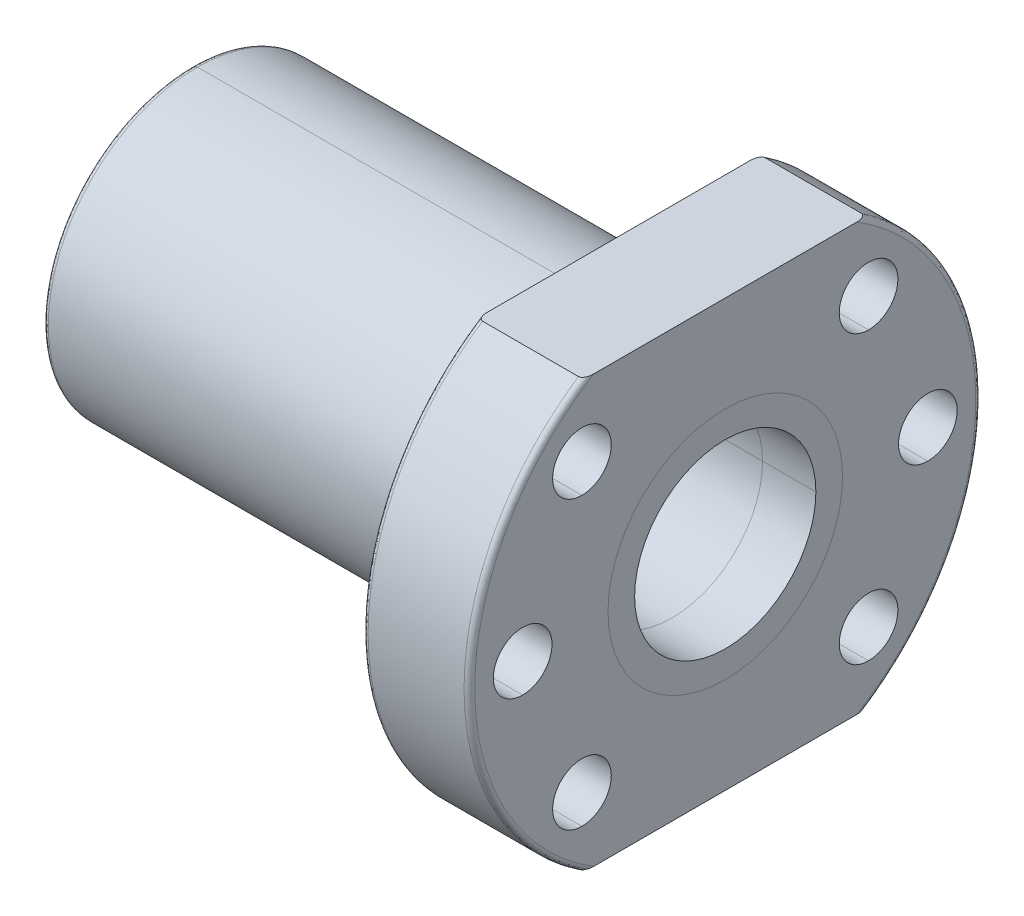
ISO-10303-21;
HEADER;
FILE_DESCRIPTION(('STEP AP214'),'2;1');
FILE_NAME('part.step','',(''),(''),'','','');
FILE_SCHEMA(('AUTOMOTIVE_DESIGN { 1 0 10303 214 1 1 1 1 }'));
ENDSEC;
DATA;
#1=APPLICATION_CONTEXT('core data for automotive mechanical design processes');
#2=APPLICATION_PROTOCOL_DEFINITION('international standard','automotive_design',2000,#1);
#3=PRODUCT_CONTEXT('',#1,'mechanical');
#4=PRODUCT('Part','Part','',(#3));
#5=PRODUCT_RELATED_PRODUCT_CATEGORY('part','',(#4));
#6=PRODUCT_DEFINITION_FORMATION('','',#4);
#7=PRODUCT_DEFINITION_CONTEXT('part definition',#1,'design');
#8=PRODUCT_DEFINITION('design','',#6,#7);
#9=PRODUCT_DEFINITION_SHAPE('','',#8);
#10=(LENGTH_UNIT() NAMED_UNIT(*) SI_UNIT(.MILLI.,.METRE.));
#11=(NAMED_UNIT(*) PLANE_ANGLE_UNIT() SI_UNIT($,.RADIAN.));
#12=(NAMED_UNIT(*) SI_UNIT($,.STERADIAN.) SOLID_ANGLE_UNIT());
#13=UNCERTAINTY_MEASURE_WITH_UNIT(LENGTH_MEASURE(1.E-05),#10,'distance_accuracy_value','');
#14=(GEOMETRIC_REPRESENTATION_CONTEXT(3) GLOBAL_UNCERTAINTY_ASSIGNED_CONTEXT((#13)) GLOBAL_UNIT_ASSIGNED_CONTEXT((#10,
#11,#12)) REPRESENTATION_CONTEXT('',''));
#15=CARTESIAN_POINT('',(0.,0.,0.));
#16=DIRECTION('',(0.,0.,1.));
#17=DIRECTION('',(1.,0.,0.));
#18=AXIS2_PLACEMENT_3D('',#15,#16,#17);
#19=CARTESIAN_POINT('',(-15.,0.,0.));
#20=DIRECTION('',(-1.,0.,0.));
#21=DIRECTION('',(0.,0.,1.));
#22=AXIS2_PLACEMENT_3D('',#19,#20,#21);
#23=CYLINDRICAL_SURFACE('',#22,11.);
#24=CARTESIAN_POINT('',(-15.,0.,0.));
#25=DIRECTION('',(-1.,0.,0.));
#26=DIRECTION('',(0.,0.,1.));
#27=AXIS2_PLACEMENT_3D('',#24,#25,#26);
#28=CIRCLE('',#27,11.);
#29=CARTESIAN_POINT('',(-15.,0.,11.));
#30=VERTEX_POINT('',#29);
#31=CARTESIAN_POINT('',(-15.,0.,-11.));
#32=VERTEX_POINT('',#31);
#33=EDGE_CURVE('P0_E109',#30,#32,#28,.T.);
#34=ORIENTED_EDGE('',*,*,#33,.T.);
#35=DIRECTION('',(-1.,0.,0.));
#36=VECTOR('',#35,1.);
#37=CARTESIAN_POINT('',(-15.,0.,-11.));
#38=LINE('',#37,#36);
#39=CARTESIAN_POINT('',(-20.,0.,-11.));
#40=VERTEX_POINT('',#39);
#41=EDGE_CURVE('P0_E26',#32,#40,#38,.T.);
#42=ORIENTED_EDGE('',*,*,#41,.T.);
#43=CARTESIAN_POINT('',(-20.,0.,0.));
#44=DIRECTION('',(1.,0.,0.));
#45=DIRECTION('',(0.,0.,1.));
#46=AXIS2_PLACEMENT_3D('',#43,#44,#45);
#47=CIRCLE('',#46,11.);
#48=CARTESIAN_POINT('',(-20.,0.,11.));
#49=VERTEX_POINT('',#48);
#50=EDGE_CURVE('P0_E104',#40,#49,#47,.T.);
#51=ORIENTED_EDGE('',*,*,#50,.T.);
#52=DIRECTION('',(-1.,0.,0.));
#53=VECTOR('',#52,1.);
#54=CARTESIAN_POINT('',(-15.,0.,11.));
#55=LINE('',#54,#53);
#56=EDGE_CURVE('P0_E11',#30,#49,#55,.T.);
#57=ORIENTED_EDGE('',*,*,#56,.F.);
#58=EDGE_LOOP('',(#34,#42,#51,#57));
#59=FACE_BOUND('',#58,.T.);
#60=ADVANCED_FACE('P0_F17',(#59),#23,.T.);
#61=CARTESIAN_POINT('',(-15.,0.,0.));
#62=DIRECTION('',(-1.,0.,0.));
#63=DIRECTION('',(0.,0.,1.));
#64=AXIS2_PLACEMENT_3D('',#61,#62,#63);
#65=CYLINDRICAL_SURFACE('',#64,8.5);
#66=CARTESIAN_POINT('',(-15.,0.,0.));
#67=DIRECTION('',(1.,0.,0.));
#68=DIRECTION('',(0.,0.,1.));
#69=AXIS2_PLACEMENT_3D('',#66,#67,#68);
#70=CIRCLE('',#69,8.5);
#71=CARTESIAN_POINT('',(-15.,0.,8.5));
#72=VERTEX_POINT('',#71);
#73=CARTESIAN_POINT('',(-15.,0.,-8.5));
#74=VERTEX_POINT('',#73);
#75=EDGE_CURVE('P0_E73',#72,#74,#70,.T.);
#76=ORIENTED_EDGE('',*,*,#75,.T.);
#77=DIRECTION('',(-1.,0.,0.));
#78=VECTOR('',#77,1.);
#79=CARTESIAN_POINT('',(-15.,0.,-8.5));
#80=LINE('',#79,#78);
#81=CARTESIAN_POINT('',(-20.,0.,-8.5));
#82=VERTEX_POINT('',#81);
#83=EDGE_CURVE('P0_E76',#74,#82,#80,.T.);
#84=ORIENTED_EDGE('',*,*,#83,.T.);
#85=CARTESIAN_POINT('',(-20.,0.,0.));
#86=DIRECTION('',(1.,0.,0.));
#87=DIRECTION('',(0.,0.,1.));
#88=AXIS2_PLACEMENT_3D('',#85,#86,#87);
#89=CIRCLE('',#88,8.5);
#90=CARTESIAN_POINT('',(-20.,0.,8.5));
#91=VERTEX_POINT('',#90);
#92=EDGE_CURVE('P0_E101',#91,#82,#89,.T.);
#93=ORIENTED_EDGE('',*,*,#92,.F.);
#94=DIRECTION('',(-1.,0.,0.));
#95=VECTOR('',#94,1.);
#96=CARTESIAN_POINT('',(-15.,0.,8.5));
#97=LINE('',#96,#95);
#98=EDGE_CURVE('P0_E78',#72,#91,#97,.T.);
#99=ORIENTED_EDGE('',*,*,#98,.F.);
#100=EDGE_LOOP('',(#76,#84,#93,#99));
#101=FACE_BOUND('',#100,.T.);
#102=ADVANCED_FACE('P0_F19',(#101),#65,.F.);
#103=CARTESIAN_POINT('',(-15.,0.,0.));
#104=DIRECTION('',(-1.,0.,0.));
#105=DIRECTION('',(0.,0.,1.));
#106=AXIS2_PLACEMENT_3D('',#103,#104,#105);
#107=CYLINDRICAL_SURFACE('',#106,11.);
#108=ORIENTED_EDGE('',*,*,#41,.F.);
#109=CARTESIAN_POINT('',(-15.,0.,0.));
#110=DIRECTION('',(-1.,0.,0.));
#111=DIRECTION('',(0.,0.,1.));
#112=AXIS2_PLACEMENT_3D('',#109,#110,#111);
#113=CIRCLE('',#112,11.);
#114=EDGE_CURVE('P0_E83',#32,#30,#113,.T.);
#115=ORIENTED_EDGE('',*,*,#114,.T.);
#116=ORIENTED_EDGE('',*,*,#56,.T.);
#117=CARTESIAN_POINT('',(-20.,0.,0.));
#118=DIRECTION('',(1.,0.,0.));
#119=DIRECTION('',(0.,0.,1.));
#120=AXIS2_PLACEMENT_3D('',#117,#118,#119);
#121=CIRCLE('',#120,11.);
#122=EDGE_CURVE('P0_E82',#49,#40,#121,.T.);
#123=ORIENTED_EDGE('',*,*,#122,.T.);
#124=EDGE_LOOP('',(#108,#115,#116,#123));
#125=FACE_BOUND('',#124,.T.);
#126=ADVANCED_FACE('P0_F217',(#125),#107,.T.);
#127=CARTESIAN_POINT('',(-20.,9.75,0.));
#128=DIRECTION('',(-1.,0.,0.));
#129=DIRECTION('',(0.,0.,1.));
#130=AXIS2_PLACEMENT_3D('',#127,#128,#129);
#131=PLANE('',#130);
#132=ORIENTED_EDGE('',*,*,#92,.T.);
#133=CARTESIAN_POINT('',(-20.,0.,0.));
#134=DIRECTION('',(1.,0.,0.));
#135=DIRECTION('',(0.,0.,1.));
#136=AXIS2_PLACEMENT_3D('',#133,#134,#135);
#137=CIRCLE('',#136,8.5);
#138=EDGE_CURVE('P0_E94',#82,#91,#137,.T.);
#139=ORIENTED_EDGE('',*,*,#138,.T.);
#140=EDGE_LOOP('',(#132,#139));
#141=FACE_BOUND('',#140,.T.);
#142=ORIENTED_EDGE('',*,*,#122,.F.);
#143=ORIENTED_EDGE('',*,*,#50,.F.);
#144=EDGE_LOOP('',(#142,#143));
#145=FACE_BOUND('',#144,.T.);
#146=ADVANCED_FACE('P0_F207',(#141,#145),#131,.T.);
#147=CARTESIAN_POINT('',(-15.,9.75,0.));
#148=DIRECTION('',(-1.,0.,0.));
#149=DIRECTION('',(0.,0.,1.));
#150=AXIS2_PLACEMENT_3D('',#147,#148,#149);
#151=PLANE('',#150);
#152=ORIENTED_EDGE('',*,*,#75,.F.);
#153=CARTESIAN_POINT('',(-15.,0.,0.));
#154=DIRECTION('',(1.,0.,0.));
#155=DIRECTION('',(0.,0.,1.));
#156=AXIS2_PLACEMENT_3D('',#153,#154,#155);
#157=CIRCLE('',#156,8.5);
#158=EDGE_CURVE('P0_E85',#74,#72,#157,.T.);
#159=ORIENTED_EDGE('',*,*,#158,.F.);
#160=EDGE_LOOP('',(#152,#159));
#161=FACE_BOUND('',#160,.T.);
#162=ORIENTED_EDGE('',*,*,#33,.F.);
#163=ORIENTED_EDGE('',*,*,#114,.F.);
#164=EDGE_LOOP('',(#162,#163));
#165=FACE_BOUND('',#164,.T.);
#166=ADVANCED_FACE('P0_F86',(#161,#165),#151,.F.);
#167=CARTESIAN_POINT('',(-15.,0.,0.));
#168=DIRECTION('',(-1.,0.,0.));
#169=DIRECTION('',(0.,0.,1.));
#170=AXIS2_PLACEMENT_3D('',#167,#168,#169);
#171=CYLINDRICAL_SURFACE('',#170,8.5);
#172=ORIENTED_EDGE('',*,*,#83,.F.);
#173=ORIENTED_EDGE('',*,*,#158,.T.);
#174=ORIENTED_EDGE('',*,*,#98,.T.);
#175=ORIENTED_EDGE('',*,*,#138,.F.);
#176=EDGE_LOOP('',(#172,#173,#174,#175));
#177=FACE_BOUND('',#176,.T.);
#178=ADVANCED_FACE('P0_F92',(#177),#171,.F.);
#179=CLOSED_SHELL('',(#60,#102,#126,#146,#166,#178));
#180=MANIFOLD_SOLID_BREP('P0_B1',#179);
#181=CARTESIAN_POINT('',(-64.5,-13.9999999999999,0.));
#182=CARTESIAN_POINT('',(-64.5,-13.9999999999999,-28.));
#183=CARTESIAN_POINT('',(-64.5,14.0000000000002,-28.));
#184=CARTESIAN_POINT('',(-64.5,14.0000000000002,0.));
#185=CARTESIAN_POINT('',(-64.7928932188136,-13.9999999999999,0.));
#186=CARTESIAN_POINT('',(-64.7928932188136,-13.9999999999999,-28.0000000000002));
#187=CARTESIAN_POINT('',(-64.7928932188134,14.0000000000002,-28.0000000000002));
#188=CARTESIAN_POINT('',(-64.7928932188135,14.0000000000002,0.));
#189=CARTESIAN_POINT('',(-65.0000000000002,-13.7928932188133,0.));
#190=CARTESIAN_POINT('',(-65.0000000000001,-13.7928932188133,-27.585786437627));
#191=CARTESIAN_POINT('',(-65.0000000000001,13.7928932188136,-27.585786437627));
#192=CARTESIAN_POINT('',(-65.0000000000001,13.7928932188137,0.));
#193=CARTESIAN_POINT('',(-65.,-13.4999999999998,0.));
#194=CARTESIAN_POINT('',(-65.0000000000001,-13.4999999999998,-27.));
#195=CARTESIAN_POINT('',(-65.0000000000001,13.5,-27.));
#196=CARTESIAN_POINT('',(-65.,13.5000000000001,0.));
#197=(BOUNDED_SURFACE() B_SPLINE_SURFACE(3,3,((#181,#182,#183,#184),(#185,#186,#187,#188),(#189,
#190,#191,#192),(#193,#194,#195,#196)),.UNSPECIFIED.,.F.,.F.,
.F.) B_SPLINE_SURFACE_WITH_KNOTS((4,4),(4,4),(0.,1.),(0.,1.),
.UNSPECIFIED.) GEOMETRIC_REPRESENTATION_ITEM() RATIONAL_B_SPLINE_SURFACE(((1.,0.333333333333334,
0.333333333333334,1.),(0.804737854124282,0.268245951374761,0.268245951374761,0.804737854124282),
(0.804737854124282,0.268245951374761,0.268245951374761,0.804737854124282),(1.,0.333333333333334,
0.333333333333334,1.))) REPRESENTATION_ITEM('') SURFACE());
#198=CARTESIAN_POINT('',(-64.5,1.57103571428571E-13,0.));
#199=DIRECTION('',(1.,0.,0.));
#200=DIRECTION('',(0.,1.,0.));
#201=AXIS2_PLACEMENT_3D('',#198,#199,#200);
#202=CIRCLE('',#201,14.);
#203=CARTESIAN_POINT('',(-64.5,-13.9999999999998,0.));
#204=VERTEX_POINT('',#203);
#205=CARTESIAN_POINT('',(-64.5,14.0000000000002,0.));
#206=VERTEX_POINT('',#205);
#207=EDGE_CURVE('P1_E10',#204,#206,#202,.T.);
#208=CARTESIAN_POINT('',(-64.5,-13.4999999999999,0.));
#209=DIRECTION('',(0.,0.,-1.));
#210=DIRECTION('',(0.,-1.,0.));
#211=AXIS2_PLACEMENT_3D('',#208,#209,#210);
#212=CIRCLE('',#211,0.499999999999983);
#213=CARTESIAN_POINT('',(-65.,-13.4999999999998,0.));
#214=VERTEX_POINT('',#213);
#215=EDGE_CURVE('P1_E619',#204,#214,#212,.T.);
#216=CARTESIAN_POINT('',(-65.,-13.4999999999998,0.));
#217=CARTESIAN_POINT('',(-65.0000000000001,-13.4999999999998,-27.));
#218=CARTESIAN_POINT('',(-65.0000000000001,13.5,-27.));
#219=CARTESIAN_POINT('',(-65.,13.5000000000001,0.));
#220=(BOUNDED_CURVE() B_SPLINE_CURVE(3,(#216,#217,#218,#219),.UNSPECIFIED.,.F.,
.F.) B_SPLINE_CURVE_WITH_KNOTS((4,4),(0.,1.),
.UNSPECIFIED.) CURVE() GEOMETRIC_REPRESENTATION_ITEM() RATIONAL_B_SPLINE_CURVE((1.,
0.333333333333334,0.333333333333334,1.)) REPRESENTATION_ITEM(''));
#221=CARTESIAN_POINT('',(-65.,13.5000000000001,0.));
#222=VERTEX_POINT('',#221);
#223=EDGE_CURVE('P1_E944',#214,#222,#220,.T.);
#224=CARTESIAN_POINT('',(-64.5,13.5000000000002,0.));
#225=DIRECTION('',(0.,0.,1.));
#226=DIRECTION('',(0.,1.,0.));
#227=AXIS2_PLACEMENT_3D('',#224,#225,#226);
#228=CIRCLE('',#227,0.499999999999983);
#229=EDGE_CURVE('P1_E614',#206,#222,#228,.T.);
#230=ORIENTED_EDGE('',*,*,#207,.F.);
#231=ORIENTED_EDGE('',*,*,#215,.T.);
#232=ORIENTED_EDGE('',*,*,#223,.T.);
#233=ORIENTED_EDGE('',*,*,#229,.F.);
#234=EDGE_LOOP('',(#230,#231,#232,#233));
#235=FACE_BOUND('',#234,.T.);
#236=ADVANCED_FACE('P1_F16',(#235),#197,.T.);
#237=CARTESIAN_POINT('',(-64.5,1.57103571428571E-13,0.));
#238=DIRECTION('',(1.,0.,0.));
#239=DIRECTION('',(0.,1.,0.));
#240=AXIS2_PLACEMENT_3D('',#237,#238,#239);
#241=CYLINDRICAL_SURFACE('',#240,14.);
#242=DIRECTION('',(1.,0.,0.));
#243=VECTOR('',#242,1.);
#244=CARTESIAN_POINT('',(-64.5,-13.9999999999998,0.));
#245=LINE('',#244,#243);
#246=CARTESIAN_POINT('',(-25.,-14.,0.));
#247=VERTEX_POINT('',#246);
#248=EDGE_CURVE('P1_E1742',#204,#247,#245,.T.);
#249=ORIENTED_EDGE('',*,*,#248,.F.);
#250=ORIENTED_EDGE('',*,*,#207,.T.);
#251=DIRECTION('',(1.,0.,0.));
#252=VECTOR('',#251,1.);
#253=CARTESIAN_POINT('',(-64.5,14.0000000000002,0.));
#254=LINE('',#253,#252);
#255=CARTESIAN_POINT('',(-25.,14.,0.));
#256=VERTEX_POINT('',#255);
#257=EDGE_CURVE('P1_E1748',#206,#256,#254,.T.);
#258=ORIENTED_EDGE('',*,*,#257,.T.);
#259=CARTESIAN_POINT('',(-25.,0.,0.));
#260=DIRECTION('',(-1.,0.,0.));
#261=DIRECTION('',(0.,1.,0.));
#262=AXIS2_PLACEMENT_3D('',#259,#260,#261);
#263=CIRCLE('',#262,14.);
#264=EDGE_CURVE('P1_E278',#256,#247,#263,.T.);
#265=ORIENTED_EDGE('',*,*,#264,.T.);
#266=EDGE_LOOP('',(#249,#250,#258,#265));
#267=FACE_BOUND('',#266,.T.);
#268=ADVANCED_FACE('P1_F1395',(#267),#241,.T.);
#269=CARTESIAN_POINT('',(-15.,13.44,13.44));
#270=DIRECTION('',(-1.,0.,0.));
#271=DIRECTION('',(0.,-1.,0.));
#272=AXIS2_PLACEMENT_3D('',#269,#270,#271);
#273=CYLINDRICAL_SURFACE('',#272,2.75);
#274=CARTESIAN_POINT('',(-15.,13.44,13.44));
#275=DIRECTION('',(-1.,0.,0.));
#276=DIRECTION('',(0.,-1.,0.));
#277=AXIS2_PLACEMENT_3D('',#274,#275,#276);
#278=CIRCLE('',#277,2.75);
#279=CARTESIAN_POINT('',(-15.,16.19,13.44));
#280=VERTEX_POINT('',#279);
#281=CARTESIAN_POINT('',(-15.,10.69,13.44));
#282=VERTEX_POINT('',#281);
#283=EDGE_CURVE('P1_E53',#280,#282,#278,.T.);
#284=ORIENTED_EDGE('',*,*,#283,.F.);
#285=DIRECTION('',(-1.,0.,0.));
#286=VECTOR('',#285,1.);
#287=CARTESIAN_POINT('',(-15.,16.19,13.44));
#288=LINE('',#287,#286);
#289=CARTESIAN_POINT('',(-25.,16.19,13.44));
#290=VERTEX_POINT('',#289);
#291=EDGE_CURVE('P1_E761',#280,#290,#288,.T.);
#292=ORIENTED_EDGE('',*,*,#291,.T.);
#293=CARTESIAN_POINT('',(-25.,13.4400000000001,13.44));
#294=DIRECTION('',(1.,0.,0.));
#295=DIRECTION('',(0.,-1.,0.));
#296=AXIS2_PLACEMENT_3D('',#293,#294,#295);
#297=CIRCLE('',#296,2.75);
#298=CARTESIAN_POINT('',(-25.,10.6900000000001,13.44));
#299=VERTEX_POINT('',#298);
#300=EDGE_CURVE('P1_E43',#299,#290,#297,.T.);
#301=ORIENTED_EDGE('',*,*,#300,.F.);
#302=DIRECTION('',(-1.,0.,0.));
#303=VECTOR('',#302,1.);
#304=CARTESIAN_POINT('',(-15.,10.69,13.44));
#305=LINE('',#304,#303);
#306=EDGE_CURVE('P1_E744',#282,#299,#305,.T.);
#307=ORIENTED_EDGE('',*,*,#306,.F.);
#308=EDGE_LOOP('',(#284,#292,#301,#307));
#309=FACE_BOUND('',#308,.T.);
#310=ADVANCED_FACE('P1_F1382',(#309),#273,.F.);
#311=CARTESIAN_POINT('',(-15.,-13.44,13.44));
#312=DIRECTION('',(-1.,0.,0.));
#313=DIRECTION('',(0.,-1.,0.));
#314=AXIS2_PLACEMENT_3D('',#311,#312,#313);
#315=CYLINDRICAL_SURFACE('',#314,2.75);
#316=CARTESIAN_POINT('',(-15.,-13.44,13.44));
#317=DIRECTION('',(-1.,0.,0.));
#318=DIRECTION('',(0.,-1.,0.));
#319=AXIS2_PLACEMENT_3D('',#316,#317,#318);
#320=CIRCLE('',#319,2.75);
#321=CARTESIAN_POINT('',(-15.,-10.69,13.44));
#322=VERTEX_POINT('',#321);
#323=CARTESIAN_POINT('',(-15.,-16.19,13.44));
#324=VERTEX_POINT('',#323);
#325=EDGE_CURVE('P1_E1037',#322,#324,#320,.T.);
#326=ORIENTED_EDGE('',*,*,#325,.F.);
#327=DIRECTION('',(-1.,0.,0.));
#328=VECTOR('',#327,1.);
#329=CARTESIAN_POINT('',(-15.,-10.69,13.44));
#330=LINE('',#329,#328);
#331=CARTESIAN_POINT('',(-25.,-10.6899999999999,13.44));
#332=VERTEX_POINT('',#331);
#333=EDGE_CURVE('P1_E789',#322,#332,#330,.T.);
#334=ORIENTED_EDGE('',*,*,#333,.T.);
#335=CARTESIAN_POINT('',(-25.,-13.4399999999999,13.44));
#336=DIRECTION('',(1.,0.,0.));
#337=DIRECTION('',(0.,-1.,0.));
#338=AXIS2_PLACEMENT_3D('',#335,#336,#337);
#339=CIRCLE('',#338,2.75);
#340=CARTESIAN_POINT('',(-25.,-16.19,13.44));
#341=VERTEX_POINT('',#340);
#342=EDGE_CURVE('P1_E677',#341,#332,#339,.T.);
#343=ORIENTED_EDGE('',*,*,#342,.F.);
#344=DIRECTION('',(-1.,0.,0.));
#345=VECTOR('',#344,1.);
#346=CARTESIAN_POINT('',(-15.,-16.19,13.44));
#347=LINE('',#346,#345);
#348=EDGE_CURVE('P1_E775',#324,#341,#347,.T.);
#349=ORIENTED_EDGE('',*,*,#348,.F.);
#350=EDGE_LOOP('',(#326,#334,#343,#349));
#351=FACE_BOUND('',#350,.T.);
#352=ADVANCED_FACE('P1_F1369',(#351),#315,.F.);
#353=CARTESIAN_POINT('',(-15.,-13.44,-13.44));
#354=DIRECTION('',(-1.,0.,0.));
#355=DIRECTION('',(0.,-1.,0.));
#356=AXIS2_PLACEMENT_3D('',#353,#354,#355);
#357=CYLINDRICAL_SURFACE('',#356,2.75);
#358=CARTESIAN_POINT('',(-15.,-13.44,-13.44));
#359=DIRECTION('',(-1.,0.,0.));
#360=DIRECTION('',(0.,-1.,0.));
#361=AXIS2_PLACEMENT_3D('',#358,#359,#360);
#362=CIRCLE('',#361,2.75);
#363=CARTESIAN_POINT('',(-15.,-10.69,-13.44));
#364=VERTEX_POINT('',#363);
#365=CARTESIAN_POINT('',(-15.,-16.19,-13.44));
#366=VERTEX_POINT('',#365);
#367=EDGE_CURVE('P1_E843',#364,#366,#362,.T.);
#368=ORIENTED_EDGE('',*,*,#367,.F.);
#369=DIRECTION('',(-1.,0.,0.));
#370=VECTOR('',#369,1.);
#371=CARTESIAN_POINT('',(-15.,-10.69,-13.44));
#372=LINE('',#371,#370);
#373=CARTESIAN_POINT('',(-25.,-10.6899999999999,-13.44));
#374=VERTEX_POINT('',#373);
#375=EDGE_CURVE('P1_E811',#364,#374,#372,.T.);
#376=ORIENTED_EDGE('',*,*,#375,.T.);
#377=CARTESIAN_POINT('',(-25.,-13.4399999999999,-13.44));
#378=DIRECTION('',(1.,0.,0.));
#379=DIRECTION('',(0.,-1.,0.));
#380=AXIS2_PLACEMENT_3D('',#377,#378,#379);
#381=CIRCLE('',#380,2.75);
#382=CARTESIAN_POINT('',(-25.,-16.19,-13.44));
#383=VERTEX_POINT('',#382);
#384=EDGE_CURVE('P1_E685',#383,#374,#381,.T.);
#385=ORIENTED_EDGE('',*,*,#384,.F.);
#386=DIRECTION('',(-1.,0.,0.));
#387=VECTOR('',#386,1.);
#388=CARTESIAN_POINT('',(-15.,-16.19,-13.44));
#389=LINE('',#388,#387);
#390=EDGE_CURVE('P1_E800',#366,#383,#389,.T.);
#391=ORIENTED_EDGE('',*,*,#390,.F.);
#392=EDGE_LOOP('',(#368,#376,#385,#391));
#393=FACE_BOUND('',#392,.T.);
#394=ADVANCED_FACE('P1_F1356',(#393),#357,.F.);
#395=CARTESIAN_POINT('',(-15.,13.44,-13.44));
#396=DIRECTION('',(-1.,0.,0.));
#397=DIRECTION('',(0.,-1.,0.));
#398=AXIS2_PLACEMENT_3D('',#395,#396,#397);
#399=CYLINDRICAL_SURFACE('',#398,2.75);
#400=CARTESIAN_POINT('',(-15.,13.44,-13.44));
#401=DIRECTION('',(-1.,0.,0.));
#402=DIRECTION('',(0.,-1.,0.));
#403=AXIS2_PLACEMENT_3D('',#400,#401,#402);
#404=CIRCLE('',#403,2.75);
#405=CARTESIAN_POINT('',(-15.,16.19,-13.44));
#406=VERTEX_POINT('',#405);
#407=CARTESIAN_POINT('',(-15.,10.69,-13.44));
#408=VERTEX_POINT('',#407);
#409=EDGE_CURVE('P1_E839',#406,#408,#404,.T.);
#410=ORIENTED_EDGE('',*,*,#409,.F.);
#411=DIRECTION('',(-1.,0.,0.));
#412=VECTOR('',#411,1.);
#413=CARTESIAN_POINT('',(-15.,16.19,-13.44));
#414=LINE('',#413,#412);
#415=CARTESIAN_POINT('',(-25.,16.19,-13.44));
#416=VERTEX_POINT('',#415);
#417=EDGE_CURVE('P1_E832',#406,#416,#414,.T.);
#418=ORIENTED_EDGE('',*,*,#417,.T.);
#419=CARTESIAN_POINT('',(-25.,13.4400000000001,-13.44));
#420=DIRECTION('',(1.,0.,0.));
#421=DIRECTION('',(0.,-1.,0.));
#422=AXIS2_PLACEMENT_3D('',#419,#420,#421);
#423=CIRCLE('',#422,2.75);
#424=CARTESIAN_POINT('',(-25.,10.6900000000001,-13.44));
#425=VERTEX_POINT('',#424);
#426=EDGE_CURVE('P1_E692',#425,#416,#423,.T.);
#427=ORIENTED_EDGE('',*,*,#426,.F.);
#428=DIRECTION('',(-1.,0.,0.));
#429=VECTOR('',#428,1.);
#430=CARTESIAN_POINT('',(-15.,10.69,-13.44));
#431=LINE('',#430,#429);
#432=EDGE_CURVE('P1_E831',#408,#425,#431,.T.);
#433=ORIENTED_EDGE('',*,*,#432,.F.);
#434=EDGE_LOOP('',(#410,#418,#427,#433));
#435=FACE_BOUND('',#434,.T.);
#436=ADVANCED_FACE('P1_F1343',(#435),#399,.F.);
#437=CARTESIAN_POINT('',(-15.,0.,19.));
#438=DIRECTION('',(-1.,0.,0.));
#439=DIRECTION('',(0.,-1.,0.));
#440=AXIS2_PLACEMENT_3D('',#437,#438,#439);
#441=CYLINDRICAL_SURFACE('',#440,2.75);
#442=CARTESIAN_POINT('',(-15.,0.,19.));
#443=DIRECTION('',(-1.,0.,0.));
#444=DIRECTION('',(0.,-1.,0.));
#445=AXIS2_PLACEMENT_3D('',#442,#443,#444);
#446=CIRCLE('',#445,2.75);
#447=CARTESIAN_POINT('',(-15.,2.75000000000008,19.));
#448=VERTEX_POINT('',#447);
#449=CARTESIAN_POINT('',(-15.,-2.74999999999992,19.));
#450=VERTEX_POINT('',#449);
#451=EDGE_CURVE('P1_E844',#448,#450,#446,.T.);
#452=ORIENTED_EDGE('',*,*,#451,.F.);
#453=DIRECTION('',(-1.,0.,0.));
#454=VECTOR('',#453,1.);
#455=CARTESIAN_POINT('',(-15.,2.75000000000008,19.));
#456=LINE('',#455,#454);
#457=CARTESIAN_POINT('',(-25.,2.7500000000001,19.));
#458=VERTEX_POINT('',#457);
#459=EDGE_CURVE('P1_E881',#448,#458,#456,.T.);
#460=ORIENTED_EDGE('',*,*,#459,.T.);
#461=CARTESIAN_POINT('',(-25.,0.,19.));
#462=DIRECTION('',(1.,0.,0.));
#463=DIRECTION('',(0.,-1.,0.));
#464=AXIS2_PLACEMENT_3D('',#461,#462,#463);
#465=CIRCLE('',#464,2.75);
#466=CARTESIAN_POINT('',(-25.,-2.7499999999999,19.));
#467=VERTEX_POINT('',#466);
#468=EDGE_CURVE('P1_E700',#467,#458,#465,.T.);
#469=ORIENTED_EDGE('',*,*,#468,.F.);
#470=DIRECTION('',(-1.,0.,0.));
#471=VECTOR('',#470,1.);
#472=CARTESIAN_POINT('',(-15.,-2.74999999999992,19.));
#473=LINE('',#472,#471);
#474=EDGE_CURVE('P1_E863',#450,#467,#473,.T.);
#475=ORIENTED_EDGE('',*,*,#474,.F.);
#476=EDGE_LOOP('',(#452,#460,#469,#475));
#477=FACE_BOUND('',#476,.T.);
#478=ADVANCED_FACE('P1_F1330',(#477),#441,.F.);
#479=CARTESIAN_POINT('',(-15.,0.,-19.));
#480=DIRECTION('',(-1.,0.,0.));
#481=DIRECTION('',(0.,-1.,0.));
#482=AXIS2_PLACEMENT_3D('',#479,#480,#481);
#483=CYLINDRICAL_SURFACE('',#482,2.75);
#484=CARTESIAN_POINT('',(-15.,0.,-19.));
#485=DIRECTION('',(-1.,0.,0.));
#486=DIRECTION('',(0.,-1.,0.));
#487=AXIS2_PLACEMENT_3D('',#484,#485,#486);
#488=CIRCLE('',#487,2.75);
#489=CARTESIAN_POINT('',(-15.,2.75000000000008,-19.));
#490=VERTEX_POINT('',#489);
#491=CARTESIAN_POINT('',(-15.,-2.74999999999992,-19.));
#492=VERTEX_POINT('',#491);
#493=EDGE_CURVE('P1_E565',#490,#492,#488,.T.);
#494=ORIENTED_EDGE('',*,*,#493,.F.);
#495=DIRECTION('',(-1.,0.,0.));
#496=VECTOR('',#495,1.);
#497=CARTESIAN_POINT('',(-15.,2.75000000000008,-19.));
#498=LINE('',#497,#496);
#499=CARTESIAN_POINT('',(-25.,2.7500000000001,-19.));
#500=VERTEX_POINT('',#499);
#501=EDGE_CURVE('P1_E923',#490,#500,#498,.T.);
#502=ORIENTED_EDGE('',*,*,#501,.T.);
#503=CARTESIAN_POINT('',(-25.,1.01986018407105E-13,-19.));
#504=DIRECTION('',(1.,0.,0.));
#505=DIRECTION('',(0.,-1.,0.));
#506=AXIS2_PLACEMENT_3D('',#503,#504,#505);
#507=CIRCLE('',#506,2.75);
#508=CARTESIAN_POINT('',(-25.,-2.7499999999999,-19.));
#509=VERTEX_POINT('',#508);
#510=EDGE_CURVE('P1_E433',#509,#500,#507,.T.);
#511=ORIENTED_EDGE('',*,*,#510,.F.);
#512=DIRECTION('',(-1.,0.,0.));
#513=VECTOR('',#512,1.);
#514=CARTESIAN_POINT('',(-15.,-2.74999999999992,-19.));
#515=LINE('',#514,#513);
#516=EDGE_CURVE('P1_E906',#492,#509,#515,.T.);
#517=ORIENTED_EDGE('',*,*,#516,.F.);
#518=EDGE_LOOP('',(#494,#502,#511,#517));
#519=FACE_BOUND('',#518,.T.);
#520=ADVANCED_FACE('P1_F1317',(#519),#483,.F.);
#521=CARTESIAN_POINT('',(-60.,1.58321428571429E-13,0.));
#522=DIRECTION('',(-1.,0.,0.));
#523=DIRECTION('',(0.,0.,1.));
#524=AXIS2_PLACEMENT_3D('',#521,#522,#523);
#525=CYLINDRICAL_SURFACE('',#524,8.5);
#526=DIRECTION('',(-1.,0.,0.));
#527=VECTOR('',#526,1.);
#528=CARTESIAN_POINT('',(-60.,1.59362378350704E-13,-8.5));
#529=LINE('',#528,#527);
#530=CARTESIAN_POINT('',(-20.,1.59362378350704E-13,-8.5));
#531=VERTEX_POINT('',#530);
#532=CARTESIAN_POINT('',(-65.,1.59362378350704E-13,-8.5));
#533=VERTEX_POINT('',#532);
#534=EDGE_CURVE('P1_E1762',#531,#533,#529,.T.);
#535=ORIENTED_EDGE('',*,*,#534,.F.);
#536=CARTESIAN_POINT('',(-20.,0.,0.));
#537=DIRECTION('',(1.,0.,0.));
#538=DIRECTION('',(0.,1.,0.));
#539=AXIS2_PLACEMENT_3D('',#536,#537,#538);
#540=CIRCLE('',#539,8.5);
#541=CARTESIAN_POINT('',(-20.,1.58321428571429E-13,8.5));
#542=VERTEX_POINT('',#541);
#543=EDGE_CURVE('P1_E999',#531,#542,#540,.T.);
#544=ORIENTED_EDGE('',*,*,#543,.T.);
#545=DIRECTION('',(-1.,0.,0.));
#546=VECTOR('',#545,1.);
#547=CARTESIAN_POINT('',(-60.,1.58321428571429E-13,8.5));
#548=LINE('',#547,#546);
#549=CARTESIAN_POINT('',(-65.,1.58321428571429E-13,8.5));
#550=VERTEX_POINT('',#549);
#551=EDGE_CURVE('P1_E531',#542,#550,#548,.T.);
#552=ORIENTED_EDGE('',*,*,#551,.T.);
#553=CARTESIAN_POINT('',(-65.,1.58321428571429E-13,0.));
#554=DIRECTION('',(1.,0.,0.));
#555=DIRECTION('',(0.,0.,1.));
#556=AXIS2_PLACEMENT_3D('',#553,#554,#555);
#557=CIRCLE('',#556,8.5);
#558=EDGE_CURVE('P1_E936',#533,#550,#557,.T.);
#559=ORIENTED_EDGE('',*,*,#558,.F.);
#560=EDGE_LOOP('',(#535,#544,#552,#559));
#561=FACE_BOUND('',#560,.T.);
#562=ADVANCED_FACE('P1_F1305',(#561),#525,.F.);
#563=CARTESIAN_POINT('',(-70.,1.705E-13,0.));
#564=DIRECTION('',(1.,0.,0.));
#565=DIRECTION('',(0.,1.,0.));
#566=AXIS2_PLACEMENT_3D('',#563,#564,#565);
#567=CYLINDRICAL_SURFACE('',#566,11.);
#568=CARTESIAN_POINT('',(-20.,0.,0.));
#569=DIRECTION('',(1.,0.,0.));
#570=DIRECTION('',(0.,1.,0.));
#571=AXIS2_PLACEMENT_3D('',#568,#569,#570);
#572=CIRCLE('',#571,11.);
#573=CARTESIAN_POINT('',(-20.,-11.,0.));
#574=VERTEX_POINT('',#573);
#575=CARTESIAN_POINT('',(-20.,11.0000000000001,0.));
#576=VERTEX_POINT('',#575);
#577=EDGE_CURVE('P1_E1002',#574,#576,#572,.T.);
#578=ORIENTED_EDGE('',*,*,#577,.F.);
#579=DIRECTION('',(1.,0.,0.));
#580=VECTOR('',#579,1.);
#581=CARTESIAN_POINT('',(-70.,-11.,0.));
#582=LINE('',#581,#580);
#583=CARTESIAN_POINT('',(-15.,-11.,0.));
#584=VERTEX_POINT('',#583);
#585=EDGE_CURVE('P1_E993',#574,#584,#582,.T.);
#586=ORIENTED_EDGE('',*,*,#585,.T.);
#587=CARTESIAN_POINT('',(-15.,0.,0.));
#588=DIRECTION('',(1.,0.,0.));
#589=DIRECTION('',(0.,1.,0.));
#590=AXIS2_PLACEMENT_3D('',#587,#588,#589);
#591=CIRCLE('',#590,11.);
#592=CARTESIAN_POINT('',(-15.,11.0000000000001,0.));
#593=VERTEX_POINT('',#592);
#594=EDGE_CURVE('P1_E29',#584,#593,#591,.T.);
#595=ORIENTED_EDGE('',*,*,#594,.T.);
#596=DIRECTION('',(1.,0.,0.));
#597=VECTOR('',#596,1.);
#598=CARTESIAN_POINT('',(-70.,11.0000000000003,0.));
#599=LINE('',#598,#597);
#600=EDGE_CURVE('P1_E985',#576,#593,#599,.T.);
#601=ORIENTED_EDGE('',*,*,#600,.F.);
#602=EDGE_LOOP('',(#578,#586,#595,#601));
#603=FACE_BOUND('',#602,.T.);
#604=ADVANCED_FACE('P1_F1294',(#603),#567,.F.);
#605=CARTESIAN_POINT('',(-15.,20.149237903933,12.0937261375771));
#606=CARTESIAN_POINT('',(-15.,9.92938536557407,29.1209217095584));
#607=CARTESIAN_POINT('',(-15.,-9.92938536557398,29.1209217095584));
#608=CARTESIAN_POINT('',(-15.,-20.1492379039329,12.0937261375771));
#609=CARTESIAN_POINT('',(-14.9999999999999,20.4003687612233,12.24445679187));
#610=CARTESIAN_POINT('',(-14.9999999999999,10.0531406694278,29.4838715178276));
#611=CARTESIAN_POINT('',(-15.,-10.0531406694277,29.4838715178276));
#612=CARTESIAN_POINT('',(-15.,-20.4003687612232,12.24445679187));
#613=CARTESIAN_POINT('',(-15.2071067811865,20.5779450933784,12.3510394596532));
#614=CARTESIAN_POINT('',(-15.2071067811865,10.1406488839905,29.7405157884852));
#615=CARTESIAN_POINT('',(-15.2071067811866,-10.1406488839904,29.7405157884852));
#616=CARTESIAN_POINT('',(-15.2071067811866,-20.5779450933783,12.3510394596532));
#617=CARTESIAN_POINT('',(-15.5,20.5779450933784,12.3510394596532));
#618=CARTESIAN_POINT('',(-15.5,10.1406488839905,29.7405157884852));
#619=CARTESIAN_POINT('',(-15.5,-10.1406488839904,29.7405157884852));
#620=CARTESIAN_POINT('',(-15.5,-20.5779450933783,12.3510394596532));
#621=(BOUNDED_SURFACE() B_SPLINE_SURFACE(3,3,((#605,#606,#607,#608),(#609,#610,#611,#612),(#613,
#614,#615,#616),(#617,#618,#619,#620)),.UNSPECIFIED.,.F.,.F.,
.F.) B_SPLINE_SURFACE_WITH_KNOTS((4,4),(4,4),(0.,1.),(0.,1.),
.UNSPECIFIED.) GEOMETRIC_REPRESENTATION_ITEM() RATIONAL_B_SPLINE_SURFACE(((1.,0.676417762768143,
0.676417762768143,1.),(0.804737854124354,0.544338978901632,0.544338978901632,0.804737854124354),
(0.804737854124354,0.544338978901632,0.544338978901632,0.804737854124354),(1.,0.676417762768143,
0.676417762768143,1.))) REPRESENTATION_ITEM('') SURFACE());
#622=CARTESIAN_POINT('',(-15.5,0.,0.));
#623=DIRECTION('',(-1.,0.,0.));
#624=DIRECTION('',(0.,1.,0.));
#625=AXIS2_PLACEMENT_3D('',#622,#623,#624);
#626=CIRCLE('',#625,24.);
#627=CARTESIAN_POINT('',(-15.5,-20.,13.2664991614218));
#628=VERTEX_POINT('',#627);
#629=CARTESIAN_POINT('',(-15.5,20.,13.2664991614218));
#630=VERTEX_POINT('',#629);
#631=EDGE_CURVE('P1_E427',#628,#630,#626,.T.);
#632=CARTESIAN_POINT('',(-15.5,-19.9999999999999,13.2664991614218));
#633=CARTESIAN_POINT('',(-15.4946949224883,-20.0000000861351,13.2664995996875));
#634=CARTESIAN_POINT('',(-15.4893903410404,-20.000004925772,13.2663390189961));
#635=CARTESIAN_POINT('',(-15.478745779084,-20.000021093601,13.2657014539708));
#636=CARTESIAN_POINT('',(-15.4734059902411,-20.0000324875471,13.2652212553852));
#637=CARTESIAN_POINT('',(-15.4626992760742,-20.0000587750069,13.263942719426));
#638=CARTESIAN_POINT('',(-15.4573328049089,-20.0000737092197,13.2631406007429));
#639=CARTESIAN_POINT('',(-15.4465808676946,-20.0001045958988,13.261217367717));
#640=CARTESIAN_POINT('',(-15.44119616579,-20.0001205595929,13.2600919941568));
#641=CARTESIAN_POINT('',(-15.4304162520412,-20.0001513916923,13.2575214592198));
#642=CARTESIAN_POINT('',(-15.4250221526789,-20.0001662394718,13.2560716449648));
#643=CARTESIAN_POINT('',(-15.414232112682,-20.0001931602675,13.2528517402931));
#644=CARTESIAN_POINT('',(-15.4088376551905,-20.0002051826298,13.251076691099));
#645=CARTESIAN_POINT('',(-15.3980557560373,-20.0002252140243,13.2472060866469));
#646=CARTESIAN_POINT('',(-15.392670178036,-20.0002331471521,13.2451053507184));
#647=CARTESIAN_POINT('',(-15.3819150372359,-20.0002442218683,13.2405834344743));
#648=CARTESIAN_POINT('',(-15.3765477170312,-20.0002472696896,13.2381569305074));
#649=CARTESIAN_POINT('',(-15.3658381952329,-20.0002482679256,13.2329838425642));
#650=CARTESIAN_POINT('',(-15.3604986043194,-20.0002461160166,13.230231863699));
#651=CARTESIAN_POINT('',(-15.3498537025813,-20.0002368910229,13.2244085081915));
#652=CARTESIAN_POINT('',(-15.3445513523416,-20.0002297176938,13.2213317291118));
#653=CARTESIAN_POINT('',(-15.3339901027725,-20.0002111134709,13.2148597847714));
#654=CARTESIAN_POINT('',(-15.3287344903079,-20.0001995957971,13.2114592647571));
#655=CARTESIAN_POINT('',(-15.3182758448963,-20.0001734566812,13.2043411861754));
#656=CARTESIAN_POINT('',(-15.3130763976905,-20.0001587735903,13.2006183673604));
#657=CARTESIAN_POINT('',(-15.302739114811,-20.0001279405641,13.1928573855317));
#658=CARTESIAN_POINT('',(-15.2976051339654,-20.0001117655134,13.1888140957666));
#659=CARTESIAN_POINT('',(-15.2874076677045,-20.0000800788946,13.1804141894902));
#660=CARTESIAN_POINT('',(-15.2823482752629,-20.0000645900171,13.176052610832));
#661=CARTESIAN_POINT('',(-15.2723086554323,-20.0000368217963,13.1670185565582));
#662=CARTESIAN_POINT('',(-15.2673327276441,-20.0000246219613,13.1623413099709));
#663=CARTESIAN_POINT('',(-15.2574684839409,-20.0000066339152,13.1526783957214));
#664=CARTESIAN_POINT('',(-15.2525846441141,-20.0000009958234,13.1476881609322));
#665=CARTESIAN_POINT('',(-15.2444142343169,-19.9999992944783,13.1389999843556));
#666=CARTESIAN_POINT('',(-15.2410770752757,-20.0000009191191,13.1353494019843));
#667=CARTESIAN_POINT('',(-15.2344106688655,-20.0000068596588,13.1278594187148));
#668=CARTESIAN_POINT('',(-15.2310841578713,-20.0000112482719,13.1240175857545));
#669=CARTESIAN_POINT('',(-15.2209897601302,-20.0000269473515,13.1120505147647));
#670=CARTESIAN_POINT('',(-15.2143886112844,-20.0000406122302,13.1037839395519));
#671=CARTESIAN_POINT('',(-15.2012591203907,-20.0000663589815,13.08650042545));
#672=CARTESIAN_POINT('',(-15.1947527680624,-20.0000783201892,13.07746687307));
#673=CARTESIAN_POINT('',(-15.1818490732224,-20.00009580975,13.0586476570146));
#674=CARTESIAN_POINT('',(-15.1754736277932,-20.0001009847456,13.0488470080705));
#675=CARTESIAN_POINT('',(-15.1628699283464,-20.0001029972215,13.0284951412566));
#676=CARTESIAN_POINT('',(-15.1566634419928,-20.0000994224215,13.0179304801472));
#677=CARTESIAN_POINT('',(-15.1444361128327,-20.0000844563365,12.9960546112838));
#678=CARTESIAN_POINT('',(-15.1384368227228,-20.0000727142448,12.9847313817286));
#679=CARTESIAN_POINT('',(-15.1266642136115,-20.0000482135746,12.9613446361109));
#680=CARTESIAN_POINT('',(-15.1209122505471,-20.0000354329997,12.949270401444));
#681=CARTESIAN_POINT('',(-15.109667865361,-20.000007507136,12.9243926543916));
#682=CARTESIAN_POINT('',(-15.1041962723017,-19.9999922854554,12.9115797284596));
#683=CARTESIAN_POINT('',(-15.0957863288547,-20.0000047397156,12.8907252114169));
#684=CARTESIAN_POINT('',(-15.0926847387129,-20.0000181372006,12.8827489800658));
#685=CARTESIAN_POINT('',(-15.0863725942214,-20.0000644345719,12.8659300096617));
#686=CARTESIAN_POINT('',(-15.0831818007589,-20.0000991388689,12.8570798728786));
#687=CARTESIAN_POINT('',(-15.0730929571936,-20.0002085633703,12.8280344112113));
#688=CARTESIAN_POINT('',(-15.0666264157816,-20.0002782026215,12.8076881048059));
#689=CARTESIAN_POINT('',(-15.0537397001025,-20.0003562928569,12.7635280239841));
#690=CARTESIAN_POINT('',(-15.0474830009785,-20.0003535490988,12.7396669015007));
#691=CARTESIAN_POINT('',(-15.0354573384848,-20.0002696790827,12.6885074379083));
#692=CARTESIAN_POINT('',(-15.0298599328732,-20.0001783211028,12.6611686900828));
#693=CARTESIAN_POINT('',(-15.0219989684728,-20.0000447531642,12.616612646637));
#694=CARTESIAN_POINT('',(-15.019274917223,-19.9999970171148,12.5994747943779));
#695=CARTESIAN_POINT('',(-15.015186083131,-19.9999165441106,12.5707602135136));
#696=CARTESIAN_POINT('',(-15.0136686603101,-19.9998840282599,12.5592049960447));
#697=CARTESIAN_POINT('',(-15.0092182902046,-19.9997637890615,12.5222991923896));
#698=CARTESIAN_POINT('',(-15.0067489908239,-19.9996564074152,12.496891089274));
#699=CARTESIAN_POINT('',(-15.0031260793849,-19.9995419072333,12.4482877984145));
#700=CARTESIAN_POINT('',(-15.0018738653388,-19.9995266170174,12.4250997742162));
#701=CARTESIAN_POINT('',(-15.0003522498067,-19.9996518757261,12.3809432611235));
#702=CARTESIAN_POINT('',(-14.9999993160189,-19.9997774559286,12.3599775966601));
#703=CARTESIAN_POINT('',(-15.0000000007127,-20.,12.339013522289));
#704=B_SPLINE_CURVE_WITH_KNOTS('',3,(#632,#633,#634,#635,#636,#637,#638,#639,#640,#641,#642,
#643,#644,#645,#646,#647,#648,#649,#650,#651,#652,#653,#654,#655,#656,#657,#658,#659,#660,#661,
#662,#663,#664,#665,#666,#667,#668,#669,#670,#671,#672,#673,#674,#675,#676,#677,#678,#679,#680,
#681,#682,#683,#684,#685,#686,#687,#688,#689,#690,#691,#692,#693,#694,#695,#696,#697,#698,#699,
#700,#701,#702,#703),.UNSPECIFIED.,.F.,.F.,(4,2,2,2,2,2,2,2,2,2,2,2,2,2,2,2,2,2,2,2,2,2,2,2,2,2,
2,2,2,2,2,2,2,2,2,4),(0.,0.0159120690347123,0.0319866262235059,0.0482557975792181,
0.064750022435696,0.0814979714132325,0.0985265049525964,0.115860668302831,0.133523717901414,
0.151537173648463,0.169920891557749,0.188693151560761,0.20787075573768,0.227469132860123,
0.247502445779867,0.267983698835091,0.288924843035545,0.303761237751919,0.319005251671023,
0.350726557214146,0.384112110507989,0.419174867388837,0.455921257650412,0.494352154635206,
0.534463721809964,0.576248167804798,0.601919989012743,0.63014091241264,0.694159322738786,
0.768129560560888,0.851800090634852,0.903850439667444,0.938811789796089,1.0153659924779,
1.08501348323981,1.14790690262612),.UNSPECIFIED.);
#705=CARTESIAN_POINT('',(-15.,-20.,12.3390135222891));
#706=VERTEX_POINT('',#705);
#707=EDGE_CURVE('P1_E545',#628,#706,#704,.T.);
#708=CARTESIAN_POINT('',(-15.,-20.,12.3390135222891));
#709=CARTESIAN_POINT('',(-15.,-9.75548382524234,28.9440440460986));
#710=CARTESIAN_POINT('',(-15.,9.75546567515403,28.9440501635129));
#711=CARTESIAN_POINT('',(-15.,20.,12.3390308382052));
#712=(BOUNDED_CURVE() B_SPLINE_CURVE(3,(#708,#709,#710,#711),.UNSPECIFIED.,.F.,
.F.) B_SPLINE_CURVE_WITH_KNOTS((4,4),(0.175958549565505,0.824041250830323),
.UNSPECIFIED.) CURVE() GEOMETRIC_REPRESENTATION_ITEM() RATIONAL_B_SPLINE_CURVE((1.,
0.683376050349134,0.683376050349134,1.)) REPRESENTATION_ITEM(''));
#713=CARTESIAN_POINT('',(-15.,20.,12.3390308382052));
#714=VERTEX_POINT('',#713);
#715=EDGE_CURVE('P1_E559',#706,#714,#712,.T.);
#716=CARTESIAN_POINT('',(-15.0000000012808,19.9999999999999,12.3390308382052));
#717=CARTESIAN_POINT('',(-15.0000001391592,20.0000045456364,12.3622027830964));
#718=CARTESIAN_POINT('',(-15.0004464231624,20.0000594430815,12.3853756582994));
#719=CARTESIAN_POINT('',(-15.002268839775,20.0002023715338,12.4320952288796));
#720=CARTESIAN_POINT('',(-15.0036612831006,20.0002909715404,12.4556412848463));
#721=CARTESIAN_POINT('',(-15.0074472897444,20.0004298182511,12.5030559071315));
#722=CARTESIAN_POINT('',(-15.0098574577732,20.0004793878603,12.526923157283));
#723=CARTESIAN_POINT('',(-15.0157076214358,20.0003558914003,12.5749223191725));
#724=CARTESIAN_POINT('',(-15.0191636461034,20.0001792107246,12.5990522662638));
#725=CARTESIAN_POINT('',(-15.0272803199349,19.9998155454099,12.6478376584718));
#726=CARTESIAN_POINT('',(-15.0319732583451,19.9996284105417,12.6724878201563));
#727=CARTESIAN_POINT('',(-15.0425238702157,19.9994988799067,12.7207182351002));
#728=CARTESIAN_POINT('',(-15.048339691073,19.9995488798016,12.7443075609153));
#729=CARTESIAN_POINT('',(-15.0610626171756,19.9996917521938,12.7903365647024));
#730=CARTESIAN_POINT('',(-15.067926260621,19.9997831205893,12.8127881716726));
#731=CARTESIAN_POINT('',(-15.0790924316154,19.9999019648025,12.8458376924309));
#732=CARTESIAN_POINT('',(-15.0829009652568,19.9999381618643,12.8566041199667));
#733=CARTESIAN_POINT('',(-15.0907532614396,19.999983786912,12.877822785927));
#734=CARTESIAN_POINT('',(-15.0947913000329,19.9999937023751,12.8882771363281));
#735=CARTESIAN_POINT('',(-15.1042051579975,20.0000078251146,12.9115777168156));
#736=CARTESIAN_POINT('',(-15.1096678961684,20.0000100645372,12.9243890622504));
#737=CARTESIAN_POINT('',(-15.1209046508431,20.0000288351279,12.9492634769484));
#738=CARTESIAN_POINT('',(-15.1266576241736,20.0000447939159,12.9613360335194));
#739=CARTESIAN_POINT('',(-15.1384319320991,20.0000721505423,12.9847232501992));
#740=CARTESIAN_POINT('',(-15.1444321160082,20.0000837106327,12.9960485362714));
#741=CARTESIAN_POINT('',(-15.1566639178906,20.0000995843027,13.0179311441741));
#742=CARTESIAN_POINT('',(-15.1628740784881,20.0001041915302,13.0285004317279));
#743=CARTESIAN_POINT('',(-15.1754873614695,20.0001039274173,13.048864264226));
#744=CARTESIAN_POINT('',(-15.1818688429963,20.0000994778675,13.0586721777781));
#745=CARTESIAN_POINT('',(-15.1947871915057,20.0000831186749,13.0775083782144));
#746=CARTESIAN_POINT('',(-15.2013022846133,20.0000715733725,13.0865515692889));
#747=CARTESIAN_POINT('',(-15.2144518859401,20.0000458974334,13.1038566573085));
#748=CARTESIAN_POINT('',(-15.2210645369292,20.0000319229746,13.112135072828));
#749=CARTESIAN_POINT('',(-15.2311774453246,20.0000149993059,13.1241204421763));
#750=CARTESIAN_POINT('',(-15.2345107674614,20.0000100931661,13.1279689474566));
#751=CARTESIAN_POINT('',(-15.2411914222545,20.0000027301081,13.1354728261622));
#752=CARTESIAN_POINT('',(-15.2445360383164,20.0000002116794,13.1391306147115));
#753=CARTESIAN_POINT('',(-15.25270942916,19.9999997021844,13.1478192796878));
#754=CARTESIAN_POINT('',(-15.257588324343,20.0000039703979,13.1528032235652));
#755=CARTESIAN_POINT('',(-15.2674429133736,20.0000196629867,13.1624540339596));
#756=CARTESIAN_POINT('',(-15.2724141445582,20.0000309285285,13.1671254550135));
#757=CARTESIAN_POINT('',(-15.28244452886,20.0000570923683,13.1761484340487));
#758=CARTESIAN_POINT('',(-15.2874993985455,20.0000719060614,13.1805047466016));
#759=CARTESIAN_POINT('',(-15.2976880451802,20.0001025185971,13.1888946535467));
#760=CARTESIAN_POINT('',(-15.3028177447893,20.0001182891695,13.1929331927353));
#761=CARTESIAN_POINT('',(-15.3131467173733,20.0001485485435,13.2006851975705));
#762=CARTESIAN_POINT('',(-15.3183421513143,20.0001630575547,13.2044037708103));
#763=CARTESIAN_POINT('',(-15.3287930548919,20.0001890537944,13.2115138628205));
#764=CARTESIAN_POINT('',(-15.3340449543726,20.0002005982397,13.2149106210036));
#765=CARTESIAN_POINT('',(-15.3445990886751,20.0002194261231,13.2213755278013));
#766=CARTESIAN_POINT('',(-15.3498980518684,20.0002267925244,13.2244490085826));
#767=CARTESIAN_POINT('',(-15.3605365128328,20.0002365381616,13.2302662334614));
#768=CARTESIAN_POINT('',(-15.3658730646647,20.0002390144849,13.2330153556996));
#769=CARTESIAN_POINT('',(-15.3765768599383,20.000238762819,13.2381831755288));
#770=CARTESIAN_POINT('',(-15.3819415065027,20.0002361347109,13.2406072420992));
#771=CARTESIAN_POINT('',(-15.3926916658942,20.0002259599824,13.2451247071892));
#772=CARTESIAN_POINT('',(-15.3980749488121,20.0002185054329,13.2472234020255));
#773=CARTESIAN_POINT('',(-15.4088526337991,20.0001994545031,13.2510903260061));
#774=CARTESIAN_POINT('',(-15.4142451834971,20.0001879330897,13.2528637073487));
#775=CARTESIAN_POINT('',(-15.4250317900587,20.0001620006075,13.2560806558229));
#776=CARTESIAN_POINT('',(-15.4304243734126,20.000147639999,13.2575291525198));
#777=CARTESIAN_POINT('',(-15.4412016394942,20.000117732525,13.2600974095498));
#778=CARTESIAN_POINT('',(-15.4465852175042,20.0001022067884,13.2612217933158));
#779=CARTESIAN_POINT('',(-15.457335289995,20.0000721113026,13.2631433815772));
#780=CARTESIAN_POINT('',(-15.4627010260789,20.0000575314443,13.2639448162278));
#781=CARTESIAN_POINT('',(-15.4734066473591,20.0000318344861,13.2652222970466));
#782=CARTESIAN_POINT('',(-15.4787460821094,20.0000206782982,13.2657020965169));
#783=CARTESIAN_POINT('',(-15.4893903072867,20.0000048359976,13.2663391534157));
#784=CARTESIAN_POINT('',(-15.4946949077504,20.0000000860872,13.266499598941));
#785=CARTESIAN_POINT('',(-15.5,20.,13.2664991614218));
#786=B_SPLINE_CURVE_WITH_KNOTS('',3,(#716,#717,#718,#719,#720,#721,#722,#723,#724,#725,#726,
#727,#728,#729,#730,#731,#732,#733,#734,#735,#736,#737,#738,#739,#740,#741,#742,#743,#744,#745,
#746,#747,#748,#749,#750,#751,#752,#753,#754,#755,#756,#757,#758,#759,#760,#761,#762,#763,#764,
#765,#766,#767,#768,#769,#770,#771,#772,#773,#774,#775,#776,#777,#778,#779,#780,#781,#782,#783,
#784,#785),.UNSPECIFIED.,.F.,.F.,(4,2,2,2,2,2,2,2,2,2,2,2,2,2,2,2,2,2,2,2,2,2,2,2,2,2,2,2,2,2,2,
2,2,2,4),(0.,0.0695130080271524,0.140255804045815,0.212200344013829,0.285308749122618,
0.360556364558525,0.433407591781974,0.503799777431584,0.538056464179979,0.571673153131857,
0.613443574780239,0.65355147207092,0.691989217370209,0.728753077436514,0.763843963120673,
0.797268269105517,0.829038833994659,0.844311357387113,0.859178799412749,0.88009608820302,
0.900555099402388,0.920567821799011,0.940147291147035,0.959307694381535,0.97806447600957,
0.996434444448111,1.01443587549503,1.03208860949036,1.04941413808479,1.06643567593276,
1.08317821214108,1.0996685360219,1.11593523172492,1.13200863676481,1.14792076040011),.UNSPECIFIED.);
#787=EDGE_CURVE('P1_E580',#714,#630,#786,.T.);
#788=ORIENTED_EDGE('',*,*,#631,.F.);
#789=ORIENTED_EDGE('',*,*,#707,.T.);
#790=ORIENTED_EDGE('',*,*,#715,.T.);
#791=ORIENTED_EDGE('',*,*,#787,.T.);
#792=EDGE_LOOP('',(#788,#789,#790,#791));
#793=FACE_BOUND('',#792,.T.);
#794=ADVANCED_FACE('P1_F360',(#793),#621,.T.);
#795=CARTESIAN_POINT('',(-15.,-20.1492379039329,-12.0937261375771));
#796=CARTESIAN_POINT('',(-15.,-9.92938536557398,-29.1209217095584));
#797=CARTESIAN_POINT('',(-15.,9.92938536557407,-29.1209217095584));
#798=CARTESIAN_POINT('',(-15.,20.149237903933,-12.0937261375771));
#799=CARTESIAN_POINT('',(-15.,-20.4003687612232,-12.24445679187));
#800=CARTESIAN_POINT('',(-15.,-10.0531406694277,-29.4838715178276));
#801=CARTESIAN_POINT('',(-14.9999999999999,10.0531406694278,-29.4838715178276));
#802=CARTESIAN_POINT('',(-14.9999999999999,20.4003687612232,-12.24445679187));
#803=CARTESIAN_POINT('',(-15.2071067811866,-20.5779450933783,-12.3510394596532));
#804=CARTESIAN_POINT('',(-15.2071067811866,-10.1406488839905,-29.7405157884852));
#805=CARTESIAN_POINT('',(-15.2071067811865,10.1406488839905,-29.7405157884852));
#806=CARTESIAN_POINT('',(-15.2071067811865,20.5779450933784,-12.3510394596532));
#807=CARTESIAN_POINT('',(-15.5,-20.5779450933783,-12.3510394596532));
#808=CARTESIAN_POINT('',(-15.5,-10.1406488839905,-29.7405157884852));
#809=CARTESIAN_POINT('',(-15.5,10.1406488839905,-29.7405157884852));
#810=CARTESIAN_POINT('',(-15.5,20.5779450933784,-12.3510394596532));
#811=(BOUNDED_SURFACE() B_SPLINE_SURFACE(3,3,((#795,#796,#797,#798),(#799,#800,#801,#802),(#803,
#804,#805,#806),(#807,#808,#809,#810)),.UNSPECIFIED.,.F.,.F.,
.F.) B_SPLINE_SURFACE_WITH_KNOTS((4,4),(4,4),(0.,1.),(0.,1.),
.UNSPECIFIED.) GEOMETRIC_REPRESENTATION_ITEM() RATIONAL_B_SPLINE_SURFACE(((1.,0.676417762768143,
0.676417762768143,1.),(0.804737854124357,0.544338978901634,0.544338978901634,0.804737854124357),
(0.804737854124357,0.544338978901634,0.544338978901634,0.804737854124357),(1.,0.676417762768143,
0.676417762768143,1.))) REPRESENTATION_ITEM('') SURFACE());
#812=CARTESIAN_POINT('',(-15.,20.,-12.3390135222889));
#813=CARTESIAN_POINT('',(-15.,9.75548382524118,-28.9440440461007));
#814=CARTESIAN_POINT('',(-15.,-9.75546567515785,-28.9440501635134));
#815=CARTESIAN_POINT('',(-15.,-20.,-12.3390308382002));
#816=(BOUNDED_CURVE() B_SPLINE_CURVE(3,(#812,#813,#814,#815),.UNSPECIFIED.,.F.,
.F.) B_SPLINE_CURVE_WITH_KNOTS((4,4),(0.175958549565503,0.824041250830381),
.UNSPECIFIED.) CURVE() GEOMETRIC_REPRESENTATION_ITEM() RATIONAL_B_SPLINE_CURVE((1.,
0.683376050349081,0.683376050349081,1.)) REPRESENTATION_ITEM(''));
#817=CARTESIAN_POINT('',(-15.,20.,-12.3390135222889));
#818=VERTEX_POINT('',#817);
#819=CARTESIAN_POINT('',(-15.,-20.,-12.3390308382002));
#820=VERTEX_POINT('',#819);
#821=EDGE_CURVE('P1_E556',#818,#820,#816,.T.);
#822=CARTESIAN_POINT('',(-15.0000000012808,-19.9999999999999,-12.3390308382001));
#823=CARTESIAN_POINT('',(-15.0000001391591,-20.0000045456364,-12.362202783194));
#824=CARTESIAN_POINT('',(-15.0004464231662,-20.0000594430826,-12.3853756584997));
#825=CARTESIAN_POINT('',(-15.0022688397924,-20.0002023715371,-12.4320952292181));
#826=CARTESIAN_POINT('',(-15.0036612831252,-20.0002909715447,-12.4556412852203));
#827=CARTESIAN_POINT('',(-15.0074472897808,-20.0004298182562,-12.5030559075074));
#828=CARTESIAN_POINT('',(-15.0098574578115,-20.0004793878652,-12.5269231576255));
#829=CARTESIAN_POINT('',(-15.0157076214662,-20.0003558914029,-12.574922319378));
#830=CARTESIAN_POINT('',(-15.0191636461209,-20.0001792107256,-12.5990522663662));
#831=CARTESIAN_POINT('',(-15.027280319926,-19.9998155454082,-12.647837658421));
#832=CARTESIAN_POINT('',(-15.0319732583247,-19.9996284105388,-12.6724878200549));
#833=CARTESIAN_POINT('',(-15.0425238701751,-19.9994988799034,-12.7207182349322));
#834=CARTESIAN_POINT('',(-15.0483396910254,-19.9995488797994,-12.7443075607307));
#835=CARTESIAN_POINT('',(-15.0610626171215,-19.999691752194,-12.790336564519));
#836=CARTESIAN_POINT('',(-15.0679262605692,-19.9997831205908,-12.8127881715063));
#837=CARTESIAN_POINT('',(-15.0790924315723,-19.999901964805,-12.8458376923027));
#838=CARTESIAN_POINT('',(-15.0829009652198,-19.9999381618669,-12.8566041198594));
#839=CARTESIAN_POINT('',(-15.0907532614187,-19.9999837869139,-12.8778227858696));
#840=CARTESIAN_POINT('',(-15.0947913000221,-19.9999937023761,-12.8882771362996));
#841=CARTESIAN_POINT('',(-15.1042051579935,-20.0000078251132,-12.9115777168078));
#842=CARTESIAN_POINT('',(-15.1096678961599,-20.0000100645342,-12.9243890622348));
#843=CARTESIAN_POINT('',(-15.1209046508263,-20.0000288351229,-12.9492634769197));
#844=CARTESIAN_POINT('',(-15.1266576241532,-20.0000447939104,-12.9613360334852));
#845=CARTESIAN_POINT('',(-15.1384319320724,-20.0000721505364,-12.9847232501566));
#846=CARTESIAN_POINT('',(-15.1444321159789,-20.0000837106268,-12.9960485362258));
#847=CARTESIAN_POINT('',(-15.1566639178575,-20.0000995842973,-13.0179311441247));
#848=CARTESIAN_POINT('',(-15.1628740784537,-20.0001041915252,-13.0285004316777));
#849=CARTESIAN_POINT('',(-15.1754873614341,-20.0001039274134,-13.0488642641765));
#850=CARTESIAN_POINT('',(-15.1818688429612,-20.0000994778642,-13.05867217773));
#851=CARTESIAN_POINT('',(-15.1947871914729,-20.0000831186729,-13.077508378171));
#852=CARTESIAN_POINT('',(-15.2013022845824,-20.0000715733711,-13.0865515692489));
#853=CARTESIAN_POINT('',(-15.2144518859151,-20.000045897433,-13.1038566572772));
#854=CARTESIAN_POINT('',(-15.221064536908,-20.0000319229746,-13.112135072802));
#855=CARTESIAN_POINT('',(-15.23117744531,-20.0000149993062,-13.1241204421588));
#856=CARTESIAN_POINT('',(-15.2345107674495,-20.0000100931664,-13.1279689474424));
#857=CARTESIAN_POINT('',(-15.2411914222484,-20.0000027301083,-13.1354728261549));
#858=CARTESIAN_POINT('',(-15.2445360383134,-20.0000002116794,-13.139130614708));
#859=CARTESIAN_POINT('',(-15.2527094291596,-19.999999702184,-13.1478192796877));
#860=CARTESIAN_POINT('',(-15.257588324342,-20.0000039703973,-13.152803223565));
#861=CARTESIAN_POINT('',(-15.2674429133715,-20.0000196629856,-13.1624540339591));
#862=CARTESIAN_POINT('',(-15.2724141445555,-20.0000309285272,-13.1671254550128));
#863=CARTESIAN_POINT('',(-15.2824445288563,-20.0000570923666,-13.1761484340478));
#864=CARTESIAN_POINT('',(-15.2874993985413,-20.0000719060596,-13.1805047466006));
#865=CARTESIAN_POINT('',(-15.2976880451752,-20.0001025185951,-13.1888946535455));
#866=CARTESIAN_POINT('',(-15.3028177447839,-20.0001182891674,-13.1929331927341));
#867=CARTESIAN_POINT('',(-15.3131467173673,-20.0001485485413,-13.2006851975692));
#868=CARTESIAN_POINT('',(-15.3183421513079,-20.0001630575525,-13.204403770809));
#869=CARTESIAN_POINT('',(-15.328793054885,-20.0001890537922,-13.2115138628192));
#870=CARTESIAN_POINT('',(-15.3340449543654,-20.0002005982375,-13.2149106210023));
#871=CARTESIAN_POINT('',(-15.3445990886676,-20.0002194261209,-13.2213755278));
#872=CARTESIAN_POINT('',(-15.3498980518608,-20.0002267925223,-13.2244490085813));
#873=CARTESIAN_POINT('',(-15.360536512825,-20.0002365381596,-13.2302662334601));
#874=CARTESIAN_POINT('',(-15.3658730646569,-20.000239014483,-13.2330153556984));
#875=CARTESIAN_POINT('',(-15.3765768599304,-20.0002387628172,-13.2381831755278));
#876=CARTESIAN_POINT('',(-15.3819415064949,-20.0002361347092,-13.2406072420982));
#877=CARTESIAN_POINT('',(-15.3926916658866,-20.0002259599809,-13.2451247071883));
#878=CARTESIAN_POINT('',(-15.3980749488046,-20.0002185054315,-13.2472234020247));
#879=CARTESIAN_POINT('',(-15.4088526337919,-20.0001994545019,-13.2510903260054));
#880=CARTESIAN_POINT('',(-15.4142451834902,-20.0001879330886,-13.252863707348));
#881=CARTESIAN_POINT('',(-15.4250317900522,-20.0001620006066,-13.2560806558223));
#882=CARTESIAN_POINT('',(-15.4304243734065,-20.0001476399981,-13.2575291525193));
#883=CARTESIAN_POINT('',(-15.4412016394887,-20.0001177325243,-13.2600974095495));
#884=CARTESIAN_POINT('',(-15.4465852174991,-20.0001022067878,-13.2612217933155));
#885=CARTESIAN_POINT('',(-15.4573352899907,-20.0000721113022,-13.263143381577));
#886=CARTESIAN_POINT('',(-15.4627010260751,-20.000057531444,-13.2639448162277));
#887=CARTESIAN_POINT('',(-15.4734066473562,-20.0000318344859,-13.2652222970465));
#888=CARTESIAN_POINT('',(-15.4787460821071,-20.000020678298,-13.2657020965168));
#889=CARTESIAN_POINT('',(-15.4893903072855,-20.0000048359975,-13.2663391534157));
#890=CARTESIAN_POINT('',(-15.4946949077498,-20.0000000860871,-13.266499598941));
#891=CARTESIAN_POINT('',(-15.5,-20.,-13.2664991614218));
#892=B_SPLINE_CURVE_WITH_KNOTS('',3,(#822,#823,#824,#825,#826,#827,#828,#829,#830,#831,#832,
#833,#834,#835,#836,#837,#838,#839,#840,#841,#842,#843,#844,#845,#846,#847,#848,#849,#850,#851,
#852,#853,#854,#855,#856,#857,#858,#859,#860,#861,#862,#863,#864,#865,#866,#867,#868,#869,#870,
#871,#872,#873,#874,#875,#876,#877,#878,#879,#880,#881,#882,#883,#884,#885,#886,#887,#888,#889,
#890,#891),.UNSPECIFIED.,.F.,.F.,(4,2,2,2,2,2,2,2,2,2,2,2,2,2,2,2,2,2,2,2,2,2,2,2,2,2,2,2,2,2,2,
2,2,2,4),(0.,0.0695130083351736,0.140255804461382,0.212200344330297,0.285308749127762,
0.360556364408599,0.433407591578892,0.503799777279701,0.538056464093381,0.571673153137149,
0.613443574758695,0.65355147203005,0.691989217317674,0.728753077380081,0.763843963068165,
0.797268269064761,0.829038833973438,0.844311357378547,0.859178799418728,0.880096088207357,
0.900555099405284,0.92056782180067,0.940147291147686,0.959307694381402,0.978064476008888,
0.996434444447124,1.01443587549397,1.03208860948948,1.04941413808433,1.06643567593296,
1.0831782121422,1.09966853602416,1.11593523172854,1.13200863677,1.14792076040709),.UNSPECIFIED.);
#893=CARTESIAN_POINT('',(-15.5,-20.,-13.2664991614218));
#894=VERTEX_POINT('',#893);
#895=EDGE_CURVE('P1_E288',#820,#894,#892,.T.);
#896=CARTESIAN_POINT('',(-15.5,0.,0.));
#897=DIRECTION('',(-1.,0.,0.));
#898=DIRECTION('',(0.,1.,0.));
#899=AXIS2_PLACEMENT_3D('',#896,#897,#898);
#900=CIRCLE('',#899,24.);
#901=CARTESIAN_POINT('',(-15.5,20.,-13.2664991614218));
#902=VERTEX_POINT('',#901);
#903=EDGE_CURVE('P1_E283',#902,#894,#900,.T.);
#904=CARTESIAN_POINT('',(-15.5,20.,-13.2664991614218));
#905=CARTESIAN_POINT('',(-15.4946949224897,20.0000000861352,-13.2664995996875));
#906=CARTESIAN_POINT('',(-15.4893903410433,20.0000049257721,-13.2663390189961));
#907=CARTESIAN_POINT('',(-15.4787457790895,20.0000210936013,-13.2657014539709));
#908=CARTESIAN_POINT('',(-15.4734059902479,20.0000324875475,-13.2652212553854));
#909=CARTESIAN_POINT('',(-15.4626992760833,20.0000587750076,-13.2639427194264));
#910=CARTESIAN_POINT('',(-15.4573328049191,20.0000737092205,-13.2631406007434));
#911=CARTESIAN_POINT('',(-15.4465808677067,20.0001045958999,-13.2612173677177));
#912=CARTESIAN_POINT('',(-15.4411961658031,20.0001205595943,-13.2600919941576));
#913=CARTESIAN_POINT('',(-15.4304162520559,20.0001513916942,-13.2575214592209));
#914=CARTESIAN_POINT('',(-15.4250221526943,20.0001662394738,-13.2560716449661));
#915=CARTESIAN_POINT('',(-15.4142321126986,20.00019316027,-13.2528517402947));
#916=CARTESIAN_POINT('',(-15.4088376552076,20.0002051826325,-13.2510766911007));
#917=CARTESIAN_POINT('',(-15.3980557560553,20.0002252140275,-13.2472060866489));
#918=CARTESIAN_POINT('',(-15.3926701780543,20.0002331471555,-13.2451053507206));
#919=CARTESIAN_POINT('',(-15.3819150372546,20.0002442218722,-13.2405834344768));
#920=CARTESIAN_POINT('',(-15.37654771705,20.0002472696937,-13.23815693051));
#921=CARTESIAN_POINT('',(-15.3658381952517,20.0002482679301,-13.232983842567));
#922=CARTESIAN_POINT('',(-15.3604986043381,20.0002461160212,-13.2302318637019));
#923=CARTESIAN_POINT('',(-15.3498537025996,20.0002368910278,-13.2244085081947));
#924=CARTESIAN_POINT('',(-15.3445513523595,20.0002297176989,-13.221331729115));
#925=CARTESIAN_POINT('',(-15.3339901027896,20.0002111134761,-13.2148597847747));
#926=CARTESIAN_POINT('',(-15.3287344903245,20.0001995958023,-13.2114592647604));
#927=CARTESIAN_POINT('',(-15.3182758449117,20.0001734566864,-13.2043411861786));
#928=CARTESIAN_POINT('',(-15.3130763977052,20.0001587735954,-13.2006183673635));
#929=CARTESIAN_POINT('',(-15.302739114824,20.0001279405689,-13.1928573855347));
#930=CARTESIAN_POINT('',(-15.2976051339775,20.0001117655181,-13.1888140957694));
#931=CARTESIAN_POINT('',(-15.2874076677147,20.0000800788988,-13.1804141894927));
#932=CARTESIAN_POINT('',(-15.2823482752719,20.0000645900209,-13.1760526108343));
#933=CARTESIAN_POINT('',(-15.272308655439,20.0000368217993,-13.16701855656));
#934=CARTESIAN_POINT('',(-15.2673327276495,20.0000246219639,-13.1623413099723));
#935=CARTESIAN_POINT('',(-15.2574684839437,20.0000066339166,-13.1526783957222));
#936=CARTESIAN_POINT('',(-15.2525846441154,20.0000009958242,-13.1476881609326));
#937=CARTESIAN_POINT('',(-15.2444142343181,19.9999992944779,-13.1389999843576));
#938=CARTESIAN_POINT('',(-15.2410770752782,20.0000009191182,-13.1353494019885));
#939=CARTESIAN_POINT('',(-15.2344106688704,20.0000068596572,-13.1278594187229));
#940=CARTESIAN_POINT('',(-15.2310841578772,20.0000112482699,-13.1240175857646));
#941=CARTESIAN_POINT('',(-15.2209897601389,20.0000269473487,-13.1120505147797));
#942=CARTESIAN_POINT('',(-15.2143886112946,20.000040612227,-13.1037839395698));
#943=CARTESIAN_POINT('',(-15.2012591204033,20.000066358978,-13.0865004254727));
#944=CARTESIAN_POINT('',(-15.1947527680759,20.0000783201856,-13.0774668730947));
#945=CARTESIAN_POINT('',(-15.1818490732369,20.0000958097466,-13.0586476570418));
#946=CARTESIAN_POINT('',(-15.1754736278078,20.0001009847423,-13.0488470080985));
#947=CARTESIAN_POINT('',(-15.1628699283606,20.0001029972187,-13.0284951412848));
#948=CARTESIAN_POINT('',(-15.1566634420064,20.000099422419,-13.0179304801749));
#949=CARTESIAN_POINT('',(-15.1444361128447,20.0000844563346,-12.9960546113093));
#950=CARTESIAN_POINT('',(-15.1384368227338,20.0000727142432,-12.9847313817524));
#951=CARTESIAN_POINT('',(-15.1266642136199,20.0000482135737,-12.96134463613));
#952=CARTESIAN_POINT('',(-15.120912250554,20.0000354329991,-12.94927040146));
#953=CARTESIAN_POINT('',(-15.1096678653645,20.0000075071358,-12.9243926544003));
#954=CARTESIAN_POINT('',(-15.1041962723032,19.9999922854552,-12.9115797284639));
#955=CARTESIAN_POINT('',(-15.0957863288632,20.0000047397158,-12.8907252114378));
#956=CARTESIAN_POINT('',(-15.0926847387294,20.0000181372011,-12.8827489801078));
#957=CARTESIAN_POINT('',(-15.0863725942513,20.0000644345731,-12.8659300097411));
#958=CARTESIAN_POINT('',(-15.0831818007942,20.0000991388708,-12.8570798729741));
#959=CARTESIAN_POINT('',(-15.0730929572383,20.0002085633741,-12.8280344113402));
#960=CARTESIAN_POINT('',(-15.0666264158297,20.0002782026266,-12.8076881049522));
#961=CARTESIAN_POINT('',(-15.053739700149,20.0003562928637,-12.7635280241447));
#962=CARTESIAN_POINT('',(-15.0474830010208,20.0003535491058,-12.7396669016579));
#963=CARTESIAN_POINT('',(-15.0354573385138,20.0002696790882,-12.6885074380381));
#964=CARTESIAN_POINT('',(-15.0298599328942,20.0001783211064,-12.6611686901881));
#965=CARTESIAN_POINT('',(-15.0219989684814,20.0000447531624,-12.6166126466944));
#966=CARTESIAN_POINT('',(-15.0192749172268,19.9999970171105,-12.5994747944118));
#967=CARTESIAN_POINT('',(-15.0151860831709,19.9999165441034,-12.570760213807));
#968=CARTESIAN_POINT('',(-15.0136686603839,19.9998840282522,-12.559204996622));
#969=CARTESIAN_POINT('',(-15.0092182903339,19.9997637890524,-12.5222991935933));
#970=CARTESIAN_POINT('',(-15.0067489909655,19.9996564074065,-12.4968910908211));
#971=CARTESIAN_POINT('',(-15.0031260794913,19.9995419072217,-12.4482878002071));
#972=CARTESIAN_POINT('',(-15.001873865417,19.9995266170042,-12.4250997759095));
#973=CARTESIAN_POINT('',(-15.0003522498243,19.9996518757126,-12.3809432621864));
#974=CARTESIAN_POINT('',(-14.9999993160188,19.999777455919,-12.3599775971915));
#975=CARTESIAN_POINT('',(-15.0000000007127,20.,-12.3390135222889));
#976=B_SPLINE_CURVE_WITH_KNOTS('',3,(#904,#905,#906,#907,#908,#909,#910,#911,#912,#913,#914,
#915,#916,#917,#918,#919,#920,#921,#922,#923,#924,#925,#926,#927,#928,#929,#930,#931,#932,#933,
#934,#935,#936,#937,#938,#939,#940,#941,#942,#943,#944,#945,#946,#947,#948,#949,#950,#951,#952,
#953,#954,#955,#956,#957,#958,#959,#960,#961,#962,#963,#964,#965,#966,#967,#968,#969,#970,#971,
#972,#973,#974,#975),.UNSPECIFIED.,.F.,.F.,(4,2,2,2,2,2,2,2,2,2,2,2,2,2,2,2,2,2,2,2,2,2,2,2,2,2,
2,2,2,2,2,2,2,2,2,4),(0.,0.0159120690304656,0.0319866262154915,0.0482557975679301,
0.0647500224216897,0.0814979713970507,0.098526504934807,0.115860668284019,0.133523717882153,
0.151537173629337,0.169920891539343,0.188693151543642,0.207870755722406,0.227469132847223,
0.247502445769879,0.267983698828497,0.288924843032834,0.303761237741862,0.31900525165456,
0.350726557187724,0.384112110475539,0.419174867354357,0.455921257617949,0.494352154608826,
0.534463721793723,0.576248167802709,0.60191998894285,0.630140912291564,0.694159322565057,
0.768129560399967,0.851800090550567,0.903850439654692,0.938811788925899,1.01536599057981,
1.08501348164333,1.14790690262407),.UNSPECIFIED.);
#977=EDGE_CURVE('P1_E388',#902,#818,#976,.T.);
#978=ORIENTED_EDGE('',*,*,#821,.T.);
#979=ORIENTED_EDGE('',*,*,#895,.T.);
#980=ORIENTED_EDGE('',*,*,#903,.F.);
#981=ORIENTED_EDGE('',*,*,#977,.T.);
#982=EDGE_LOOP('',(#978,#979,#980,#981));
#983=FACE_BOUND('',#982,.T.);
#984=ADVANCED_FACE('P1_F347',(#983),#811,.T.);
#985=CARTESIAN_POINT('',(-15.,17.25,0.));
#986=DIRECTION('',(-1.,0.,0.));
#987=DIRECTION('',(0.,0.,1.));
#988=AXIS2_PLACEMENT_3D('',#985,#986,#987);
#989=PLANE('',#988);
#990=CARTESIAN_POINT('',(-15.,0.,0.));
#991=DIRECTION('',(1.,0.,0.));
#992=DIRECTION('',(0.,1.,0.));
#993=AXIS2_PLACEMENT_3D('',#990,#991,#992);
#994=CIRCLE('',#993,11.);
#995=EDGE_CURVE('P1_E980',#593,#584,#994,.T.);
#996=ORIENTED_EDGE('',*,*,#995,.F.);
#997=ORIENTED_EDGE('',*,*,#594,.F.);
#998=EDGE_LOOP('',(#996,#997));
#999=FACE_BOUND('',#998,.T.);
#1000=CARTESIAN_POINT('',(-15.,13.44,13.44));
#1001=DIRECTION('',(-1.,0.,0.));
#1002=DIRECTION('',(0.,-1.,0.));
#1003=AXIS2_PLACEMENT_3D('',#1000,#1001,#1002);
#1004=CIRCLE('',#1003,2.75);
#1005=EDGE_CURVE('P1_E753',#282,#280,#1004,.T.);
#1006=ORIENTED_EDGE('',*,*,#1005,.T.);
#1007=ORIENTED_EDGE('',*,*,#283,.T.);
#1008=EDGE_LOOP('',(#1006,#1007));
#1009=FACE_BOUND('',#1008,.T.);
#1010=CARTESIAN_POINT('',(-15.,-13.44,13.44));
#1011=DIRECTION('',(-1.,0.,0.));
#1012=DIRECTION('',(0.,-1.,0.));
#1013=AXIS2_PLACEMENT_3D('',#1010,#1011,#1012);
#1014=CIRCLE('',#1013,2.75);
#1015=EDGE_CURVE('P1_E780',#324,#322,#1014,.T.);
#1016=ORIENTED_EDGE('',*,*,#1015,.T.);
#1017=ORIENTED_EDGE('',*,*,#325,.T.);
#1018=EDGE_LOOP('',(#1016,#1017));
#1019=FACE_BOUND('',#1018,.T.);
#1020=CARTESIAN_POINT('',(-15.,-13.44,-13.44));
#1021=DIRECTION('',(-1.,0.,0.));
#1022=DIRECTION('',(0.,-1.,0.));
#1023=AXIS2_PLACEMENT_3D('',#1020,#1021,#1022);
#1024=CIRCLE('',#1023,2.75);
#1025=EDGE_CURVE('P1_E806',#366,#364,#1024,.T.);
#1026=ORIENTED_EDGE('',*,*,#1025,.T.);
#1027=ORIENTED_EDGE('',*,*,#367,.T.);
#1028=EDGE_LOOP('',(#1026,#1027));
#1029=FACE_BOUND('',#1028,.T.);
#1030=CARTESIAN_POINT('',(-15.,13.44,-13.44));
#1031=DIRECTION('',(-1.,0.,0.));
#1032=DIRECTION('',(0.,-1.,0.));
#1033=AXIS2_PLACEMENT_3D('',#1030,#1031,#1032);
#1034=CIRCLE('',#1033,2.75);
#1035=EDGE_CURVE('P1_E826',#408,#406,#1034,.T.);
#1036=ORIENTED_EDGE('',*,*,#1035,.T.);
#1037=ORIENTED_EDGE('',*,*,#409,.T.);
#1038=EDGE_LOOP('',(#1036,#1037));
#1039=FACE_BOUND('',#1038,.T.);
#1040=CARTESIAN_POINT('',(-15.,0.,19.));
#1041=DIRECTION('',(-1.,0.,0.));
#1042=DIRECTION('',(0.,-1.,0.));
#1043=AXIS2_PLACEMENT_3D('',#1040,#1041,#1042);
#1044=CIRCLE('',#1043,2.75);
#1045=EDGE_CURVE('P1_E872',#450,#448,#1044,.T.);
#1046=ORIENTED_EDGE('',*,*,#1045,.T.);
#1047=ORIENTED_EDGE('',*,*,#451,.T.);
#1048=EDGE_LOOP('',(#1046,#1047));
#1049=FACE_BOUND('',#1048,.T.);
#1050=CARTESIAN_POINT('',(-15.,0.,-19.));
#1051=DIRECTION('',(-1.,0.,0.));
#1052=DIRECTION('',(0.,-1.,0.));
#1053=AXIS2_PLACEMENT_3D('',#1050,#1051,#1052);
#1054=CIRCLE('',#1053,2.75);
#1055=EDGE_CURVE('P1_E915',#492,#490,#1054,.T.);
#1056=ORIENTED_EDGE('',*,*,#1055,.T.);
#1057=ORIENTED_EDGE('',*,*,#493,.T.);
#1058=EDGE_LOOP('',(#1056,#1057));
#1059=FACE_BOUND('',#1058,.T.);
#1060=DIRECTION('',(0.,0.,-1.));
#1061=VECTOR('',#1060,1.);
#1062=CARTESIAN_POINT('',(-15.,-20.,38.6532656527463));
#1063=LINE('',#1062,#1061);
#1064=EDGE_CURVE('P1_E542',#706,#820,#1063,.T.);
#1065=ORIENTED_EDGE('',*,*,#1064,.T.);
#1066=ORIENTED_EDGE('',*,*,#821,.F.);
#1067=DIRECTION('',(0.,0.,1.));
#1068=VECTOR('',#1067,1.);
#1069=CARTESIAN_POINT('',(-15.,20.,38.6532656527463));
#1070=LINE('',#1069,#1068);
#1071=EDGE_CURVE('P1_E574',#818,#714,#1070,.T.);
#1072=ORIENTED_EDGE('',*,*,#1071,.T.);
#1073=ORIENTED_EDGE('',*,*,#715,.F.);
#1074=EDGE_LOOP('',(#1065,#1066,#1072,#1073));
#1075=FACE_BOUND('',#1074,.T.);
#1076=ADVANCED_FACE('P1_F359',(#999,#1009,#1019,#1029,#1039,#1049,#1059,#1075),#989,.F.);
#1077=CARTESIAN_POINT('',(-70.,1.705E-13,0.));
#1078=DIRECTION('',(1.,0.,0.));
#1079=DIRECTION('',(0.,1.,0.));
#1080=AXIS2_PLACEMENT_3D('',#1077,#1078,#1079);
#1081=CYLINDRICAL_SURFACE('',#1080,24.);
#1082=ORIENTED_EDGE('',*,*,#903,.T.);
#1083=DIRECTION('',(-1.,0.,0.));
#1084=VECTOR('',#1083,1.);
#1085=CARTESIAN_POINT('',(-70.,-20.,-13.2664991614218));
#1086=LINE('',#1085,#1084);
#1087=CARTESIAN_POINT('',(-24.5,-20.,-13.2664991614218));
#1088=VERTEX_POINT('',#1087);
#1089=EDGE_CURVE('P1_E281',#894,#1088,#1086,.T.);
#1090=ORIENTED_EDGE('',*,*,#1089,.T.);
#1091=CARTESIAN_POINT('',(-24.5,0.,0.));
#1092=DIRECTION('',(-1.,0.,0.));
#1093=DIRECTION('',(0.,1.,0.));
#1094=AXIS2_PLACEMENT_3D('',#1091,#1092,#1093);
#1095=CIRCLE('',#1094,24.);
#1096=CARTESIAN_POINT('',(-24.5,20.,-13.2664991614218));
#1097=VERTEX_POINT('',#1096);
#1098=EDGE_CURVE('P1_E263',#1097,#1088,#1095,.T.);
#1099=ORIENTED_EDGE('',*,*,#1098,.F.);
#1100=DIRECTION('',(1.,0.,0.));
#1101=VECTOR('',#1100,1.);
#1102=CARTESIAN_POINT('',(-70.,20.,-13.2664991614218));
#1103=LINE('',#1102,#1101);
#1104=EDGE_CURVE('P1_E553',#1097,#902,#1103,.T.);
#1105=ORIENTED_EDGE('',*,*,#1104,.T.);
#1106=EDGE_LOOP('',(#1082,#1090,#1099,#1105));
#1107=FACE_BOUND('',#1106,.T.);
#1108=ADVANCED_FACE('P1_F282',(#1107),#1081,.T.);
#1109=CARTESIAN_POINT('',(-70.,1.705E-13,0.));
#1110=DIRECTION('',(1.,0.,0.));
#1111=DIRECTION('',(0.,1.,0.));
#1112=AXIS2_PLACEMENT_3D('',#1109,#1110,#1111);
#1113=CYLINDRICAL_SURFACE('',#1112,24.);
#1114=CARTESIAN_POINT('',(-24.5,0.,0.));
#1115=DIRECTION('',(-1.,0.,0.));
#1116=DIRECTION('',(0.,1.,0.));
#1117=AXIS2_PLACEMENT_3D('',#1114,#1115,#1116);
#1118=CIRCLE('',#1117,24.);
#1119=CARTESIAN_POINT('',(-24.5,-20.,13.2664991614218));
#1120=VERTEX_POINT('',#1119);
#1121=CARTESIAN_POINT('',(-24.5,20.,13.2664991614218));
#1122=VERTEX_POINT('',#1121);
#1123=EDGE_CURVE('P1_E277',#1120,#1122,#1118,.T.);
#1124=ORIENTED_EDGE('',*,*,#1123,.F.);
#1125=DIRECTION('',(1.,0.,0.));
#1126=VECTOR('',#1125,1.);
#1127=CARTESIAN_POINT('',(-70.,-20.,13.2664991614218));
#1128=LINE('',#1127,#1126);
#1129=EDGE_CURVE('P1_E524',#1120,#628,#1128,.T.);
#1130=ORIENTED_EDGE('',*,*,#1129,.T.);
#1131=ORIENTED_EDGE('',*,*,#631,.T.);
#1132=DIRECTION('',(-1.,0.,0.));
#1133=VECTOR('',#1132,1.);
#1134=CARTESIAN_POINT('',(-70.,20.,13.2664991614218));
#1135=LINE('',#1134,#1133);
#1136=EDGE_CURVE('P1_E596',#630,#1122,#1135,.T.);
#1137=ORIENTED_EDGE('',*,*,#1136,.T.);
#1138=EDGE_LOOP('',(#1124,#1130,#1131,#1137));
#1139=FACE_BOUND('',#1138,.T.);
#1140=ADVANCED_FACE('P1_F500',(#1139),#1113,.T.);
#1141=CARTESIAN_POINT('',(-24.5,20.5779450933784,12.3510394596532));
#1142=CARTESIAN_POINT('',(-24.5000000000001,10.1406488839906,29.7405157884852));
#1143=CARTESIAN_POINT('',(-24.5000000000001,-10.1406488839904,29.7405157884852));
#1144=CARTESIAN_POINT('',(-24.5,-20.5779450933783,12.3510394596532));
#1145=CARTESIAN_POINT('',(-24.7928932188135,20.5779450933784,12.3510394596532));
#1146=CARTESIAN_POINT('',(-24.7928932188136,10.1406488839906,29.7405157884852));
#1147=CARTESIAN_POINT('',(-24.7928932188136,-10.1406488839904,29.7405157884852));
#1148=CARTESIAN_POINT('',(-24.7928932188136,-20.5779450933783,12.3510394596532));
#1149=CARTESIAN_POINT('',(-25.0000000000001,20.4003687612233,12.24445679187));
#1150=CARTESIAN_POINT('',(-25.0000000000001,10.0531406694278,29.4838715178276));
#1151=CARTESIAN_POINT('',(-25.0000000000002,-10.0531406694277,29.4838715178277));
#1152=CARTESIAN_POINT('',(-25.0000000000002,-20.4003687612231,12.24445679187));
#1153=CARTESIAN_POINT('',(-25.,20.149237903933,12.0937261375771));
#1154=CARTESIAN_POINT('',(-25.0000000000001,9.92938536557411,29.1209217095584));
#1155=CARTESIAN_POINT('',(-25.0000000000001,-9.92938536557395,29.1209217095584));
#1156=CARTESIAN_POINT('',(-25.,-20.1492379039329,12.0937261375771));
#1157=(BOUNDED_SURFACE() B_SPLINE_SURFACE(3,3,((#1141,#1142,#1143,#1144),(#1145,#1146,#1147,
#1148),(#1149,#1150,#1151,#1152),(#1153,#1154,#1155,#1156)),.UNSPECIFIED.,.F.,.F.,
.F.) B_SPLINE_SURFACE_WITH_KNOTS((4,4),(4,4),(0.,1.),(0.,1.),
.UNSPECIFIED.) GEOMETRIC_REPRESENTATION_ITEM() RATIONAL_B_SPLINE_SURFACE(((1.,0.676417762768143,
0.676417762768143,1.),(0.804737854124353,0.54433897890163,0.54433897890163,0.804737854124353),
(0.804737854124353,0.54433897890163,0.54433897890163,0.804737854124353),(1.,0.676417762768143,
0.676417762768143,1.))) REPRESENTATION_ITEM('') SURFACE());
#1158=CARTESIAN_POINT('',(-25.,-20.0000000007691,12.3390389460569));
#1159=CARTESIAN_POINT('',(-25.,-19.866592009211,12.5552221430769));
#1160=CARTESIAN_POINT('',(-25.,-19.7306556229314,12.7678555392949));
#1161=CARTESIAN_POINT('',(-25.,-19.4435520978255,13.2010282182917));
#1162=CARTESIAN_POINT('',(-25.,-19.0028809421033,13.8426867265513));
#1163=CARTESIAN_POINT('',(-25.,-18.2183496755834,14.8716150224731));
#1164=CARTESIAN_POINT('',(-25.,-17.5373066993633,15.6515549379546));
#1165=CARTESIAN_POINT('',(-25.,-16.8295547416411,16.4098934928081));
#1166=CARTESIAN_POINT('',(-25.,-16.4617159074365,16.7788733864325));
#1167=CARTESIAN_POINT('',(-25.,-15.3275885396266,17.8439186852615));
#1168=CARTESIAN_POINT('',(-25.,-14.3281924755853,18.6649164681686));
#1169=CARTESIAN_POINT('',(-25.,-13.2609340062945,19.4027392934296));
#1170=CARTESIAN_POINT('',(-25.,-12.9366847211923,19.6190956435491));
#1171=CARTESIAN_POINT('',(-25.,-12.8285405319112,19.689963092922));
#1172=CARTESIAN_POINT('',(-25.,-12.614674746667,19.8276842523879));
#1173=CARTESIAN_POINT('',(-25.,-12.0776333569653,20.1674235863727));
#1174=CARTESIAN_POINT('',(-25.,-11.0895665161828,20.737882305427));
#1175=CARTESIAN_POINT('',(-25.,-9.9536836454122,21.2987082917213));
#1176=CARTESIAN_POINT('',(-25.,-9.13859945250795,21.6529525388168));
#1177=CARTESIAN_POINT('',(-25.,-8.78499918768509,21.7965570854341));
#1178=CARTESIAN_POINT('',(-25.,-8.60748597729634,21.8669902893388));
#1179=CARTESIAN_POINT('',(-25.,-8.55238326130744,21.8885961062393));
#1180=CARTESIAN_POINT('',(-25.,-8.43857937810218,21.9327316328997));
#1181=CARTESIAN_POINT('',(-25.,-7.47012363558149,22.30401333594));
#1182=CARTESIAN_POINT('',(-25.,-6.25021851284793,22.6813796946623));
#1183=CARTESIAN_POINT('',(-25.,-4.94316363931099,22.9765440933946));
#1184=CARTESIAN_POINT('',(-25.,-4.52450872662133,23.0608981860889));
#1185=CARTESIAN_POINT('',(-25.,-4.34449080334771,23.0950009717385));
#1186=CARTESIAN_POINT('',(-25.,-4.2543827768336,23.1117108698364));
#1187=CARTESIAN_POINT('',(-25.,-4.22731330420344,23.116676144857));
#1188=CARTESIAN_POINT('',(-25.,-4.17066878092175,23.1269656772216));
#1189=CARTESIAN_POINT('',(-25.,-3.68910603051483,23.2135343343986));
#1190=CARTESIAN_POINT('',(-25.,-3.2061101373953,23.2849327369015));
#1191=CARTESIAN_POINT('',(-25.,-1.83854853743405,23.4462141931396));
#1192=CARTESIAN_POINT('',(-25.,-0.92130938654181,23.4999831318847));
#1193=CARTESIAN_POINT('',(-25.,0.921511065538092,23.5000168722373));
#1194=CARTESIAN_POINT('',(-25.,2.29644488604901,23.4193741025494));
#1195=CARTESIAN_POINT('',(-25.,3.68902646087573,23.2135282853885));
#1196=CARTESIAN_POINT('',(-25.,4.17081579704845,23.1269346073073));
#1197=CARTESIAN_POINT('',(-25.,4.22748754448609,23.1166420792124));
#1198=CARTESIAN_POINT('',(-25.,4.25460285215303,23.1116693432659));
#1199=CARTESIAN_POINT('',(-25.,4.34467036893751,23.094970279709));
#1200=CARTESIAN_POINT('',(-25.,4.52461051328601,23.0608882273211));
#1201=CARTESIAN_POINT('',(-25.,4.94310662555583,22.9765759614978));
#1202=CARTESIAN_POINT('',(-25.,6.24980499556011,22.6815018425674));
#1203=CARTESIAN_POINT('',(-25.,7.46982349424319,22.3040906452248));
#1204=CARTESIAN_POINT('',(-25.,8.43868318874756,21.9326824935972));
#1205=CARTESIAN_POINT('',(-25.,8.55253675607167,21.8885314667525));
#1206=CARTESIAN_POINT('',(-25.,8.60771131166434,21.8668993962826));
#1207=CARTESIAN_POINT('',(-25.,8.78514914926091,21.7965030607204));
#1208=CARTESIAN_POINT('',(-25.,9.13861070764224,21.6529660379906));
#1209=CARTESIAN_POINT('',(-25.,9.95345552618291,21.29883585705));
#1210=CARTESIAN_POINT('',(-25.,11.089237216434,20.7380485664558));
#1211=CARTESIAN_POINT('',(-25.,12.0775019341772,20.167475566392));
#1212=CARTESIAN_POINT('',(-25.,12.6147535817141,19.8276209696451));
#1213=CARTESIAN_POINT('',(-25.,12.8287114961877,19.6898495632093));
#1214=CARTESIAN_POINT('',(-25.,12.9368424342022,19.6189965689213));
#1215=CARTESIAN_POINT('',(-25.,13.2609675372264,19.4027361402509));
#1216=CARTESIAN_POINT('',(-25.,14.3278836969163,18.6651749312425));
#1217=CARTESIAN_POINT('',(-25.,15.3272956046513,17.8441481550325));
#1218=CARTESIAN_POINT('',(-25.,16.4617858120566,16.7787890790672));
#1219=CARTESIAN_POINT('',(-25.,16.829620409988,16.4098454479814));
#1220=CARTESIAN_POINT('',(-25.,17.5371718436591,15.6517381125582));
#1221=CARTESIAN_POINT('',(-25.,18.2181072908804,14.8719148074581));
#1222=CARTESIAN_POINT('',(-25.,19.0027366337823,13.8428457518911));
#1223=CARTESIAN_POINT('',(-25.,19.4435712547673,13.2009738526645));
#1224=CARTESIAN_POINT('',(-25.,19.7308070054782,12.7676302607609));
#1225=CARTESIAN_POINT('',(-25.,19.8666401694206,12.555171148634));
#1226=CARTESIAN_POINT('',(-25.,20.0000000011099,12.3390649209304));
#1227=(BOUNDED_CURVE() B_SPLINE_CURVE(3,(#1158,#1159,#1160,#1161,#1162,#1163,#1164,#1165,#1166,
#1167,#1168,#1169,#1170,#1171,#1172,#1173,#1174,#1175,#1176,#1177,#1178,#1179,#1180,#1181,#1182,
#1183,#1184,#1185,#1186,#1187,#1188,#1189,#1190,#1191,#1192,#1193,#1194,#1195,#1196,#1197,#1198,
#1199,#1200,#1201,#1202,#1203,#1204,#1205,#1206,#1207,#1208,#1209,#1210,#1211,#1212,#1213,#1214,
#1215,#1216,#1217,#1218,#1219,#1220,#1221,#1222,#1223,#1224,#1225,#1226),.UNSPECIFIED.,.F.,
.F.) B_SPLINE_CURVE_WITH_KNOTS((4,2,1,1,2,2,1,2,2,1,1,1,1,2,2,1,1,1,1,2,2,1,2,2,1,1,2,2,1,1,1,1,
2,2,1,1,1,1,2,2,1,2,2,1,1,2,4),(0.179404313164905,0.189422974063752,0.199441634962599,
0.219478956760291,0.239516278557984,0.259553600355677,0.299628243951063,0.309646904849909,
0.314656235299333,0.319665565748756,0.339702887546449,0.359740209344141,0.369758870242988,
0.374768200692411,0.377272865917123,0.379777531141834,0.41985217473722,0.429870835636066,
0.434880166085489,0.437384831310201,0.438637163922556,0.439889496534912,0.459926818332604,
0.500001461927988,0.540076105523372,0.560113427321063,0.561365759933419,0.562618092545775,
0.565122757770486,0.570132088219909,0.580150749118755,0.620225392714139,0.62273005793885,
0.625234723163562,0.630244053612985,0.640262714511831,0.660300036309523,0.680337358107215,
0.685346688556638,0.690356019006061,0.700374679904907,0.740449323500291,0.760486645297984,
0.780523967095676,0.800561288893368,0.810579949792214,0.82059861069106),
.UNSPECIFIED.) CURVE() GEOMETRIC_REPRESENTATION_ITEM() RATIONAL_B_SPLINE_CURVE((1.,1.,1.,1.,1.,
1.,1.,1.,1.,1.,1.,1.,1.,1.,1.,1.,1.,1.,1.,1.,1.,1.,1.,1.,1.,1.,1.,1.,1.,1.,1.,1.,1.,1.,1.,1.,1.,
1.,1.,1.,1.,1.,1.,1.,1.,1.,1.,1.,1.,1.,1.,1.,1.,1.,1.,1.,1.,1.,1.,1.,1.,1.,1.,1.,1.,1.,1.,1.,1.)) REPRESENTATION_ITEM(''));
#1228=CARTESIAN_POINT('',(-25.,-20.0000000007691,12.3390389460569));
#1229=VERTEX_POINT('',#1228);
#1230=CARTESIAN_POINT('',(-25.,20.0000000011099,12.3390649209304));
#1231=VERTEX_POINT('',#1230);
#1232=EDGE_CURVE('P1_E430',#1229,#1231,#1227,.T.);
#1233=CARTESIAN_POINT('',(-24.9999999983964,-20.000000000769,12.3390389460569));
#1234=CARTESIAN_POINT('',(-24.9999997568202,-20.0000045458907,12.3622102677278));
#1235=CARTESIAN_POINT('',(-24.9995533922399,-20.000059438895,12.3853825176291));
#1236=CARTESIAN_POINT('',(-24.9977308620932,-20.0002023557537,12.4321008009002));
#1237=CARTESIAN_POINT('',(-24.9963383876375,-20.0002909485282,12.4556461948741));
#1238=CARTESIAN_POINT('',(-24.9925523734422,-20.0004297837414,12.5030594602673));
#1239=CARTESIAN_POINT('',(-24.9901422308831,-20.000479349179,12.5269260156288));
#1240=CARTESIAN_POINT('',(-24.9842921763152,-20.0003558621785,12.5749237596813));
#1241=CARTESIAN_POINT('',(-24.9808362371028,-20.0001791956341,12.5990529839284));
#1242=CARTESIAN_POINT('',(-24.9727196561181,-19.9998155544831,12.6478377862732));
#1243=CARTESIAN_POINT('',(-24.968026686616,-19.9996284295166,12.6724880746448));
#1244=CARTESIAN_POINT('',(-24.9574760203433,-19.9994989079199,12.7207186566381));
#1245=CARTESIAN_POINT('',(-24.9516601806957,-19.9995489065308,12.7443080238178));
#1246=CARTESIAN_POINT('',(-24.9389372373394,-19.9996917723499,12.7903370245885));
#1247=CARTESIAN_POINT('',(-24.9320736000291,-19.9997831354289,12.8127885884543));
#1248=CARTESIAN_POINT('',(-24.9209074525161,-19.9999019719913,12.8458380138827));
#1249=CARTESIAN_POINT('',(-24.9170989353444,-19.9999381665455,12.8566043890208));
#1250=CARTESIAN_POINT('',(-24.9092466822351,-19.9999837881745,12.877822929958));
#1251=CARTESIAN_POINT('',(-24.9052086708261,-19.9999937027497,12.8882772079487));
#1252=CARTESIAN_POINT('',(-24.8957948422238,-20.0000078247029,12.9115777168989));
#1253=CARTESIAN_POINT('',(-24.8903321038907,-20.000010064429,12.9243890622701));
#1254=CARTESIAN_POINT('',(-24.8790953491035,-20.0000288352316,12.9492634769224));
#1255=CARTESIAN_POINT('',(-24.8733423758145,-20.0000447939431,12.9613360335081));
#1256=CARTESIAN_POINT('',(-24.8615680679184,-20.0000721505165,12.9847232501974));
#1257=CARTESIAN_POINT('',(-24.8555678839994,-20.0000837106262,12.9960485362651));
#1258=CARTESIAN_POINT('',(-24.8433360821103,-20.0000995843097,13.0179311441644));
#1259=CARTESIAN_POINT('',(-24.8371259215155,-20.0001041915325,13.028500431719));
#1260=CARTESIAN_POINT('',(-24.824512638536,-20.0001039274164,13.0488642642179));
#1261=CARTESIAN_POINT('',(-24.8181311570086,-20.0000994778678,13.05867217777));
#1262=CARTESIAN_POINT('',(-24.8052128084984,-20.0000831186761,13.0775083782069));
#1263=CARTESIAN_POINT('',(-24.7986977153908,-20.0000715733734,13.086551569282));
#1264=CARTESIAN_POINT('',(-24.7855481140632,-20.000045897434,13.1038566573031));
#1265=CARTESIAN_POINT('',(-24.7789354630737,-20.0000319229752,13.1121350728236));
#1266=CARTESIAN_POINT('',(-24.7688225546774,-20.0000149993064,13.1241204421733));
#1267=CARTESIAN_POINT('',(-24.7654892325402,-20.0000100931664,13.1279689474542));
#1268=CARTESIAN_POINT('',(-24.7588085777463,-20.0000027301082,13.135472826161));
#1269=CARTESIAN_POINT('',(-24.755463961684,-20.0000002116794,13.1391306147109));
#1270=CARTESIAN_POINT('',(-24.7472905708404,-19.999999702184,13.1478192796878));
#1271=CARTESIAN_POINT('',(-24.7424116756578,-20.0000039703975,13.152803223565));
#1272=CARTESIAN_POINT('',(-24.7325570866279,-20.0000196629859,13.1624540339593));
#1273=CARTESIAN_POINT('',(-24.7275858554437,-20.0000309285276,13.167125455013));
#1274=CARTESIAN_POINT('',(-24.7175554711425,-20.0000570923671,13.1761484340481));
#1275=CARTESIAN_POINT('',(-24.7125006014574,-20.0000719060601,13.1805047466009));
#1276=CARTESIAN_POINT('',(-24.7023119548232,-20.0001025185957,13.1888946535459));
#1277=CARTESIAN_POINT('',(-24.6971822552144,-20.0001182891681,13.1929331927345));
#1278=CARTESIAN_POINT('',(-24.6868532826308,-20.000148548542,13.2006851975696));
#1279=CARTESIAN_POINT('',(-24.68165784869,-20.0001630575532,13.2044037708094));
#1280=CARTESIAN_POINT('',(-24.6712069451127,-20.0001890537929,13.2115138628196));
#1281=CARTESIAN_POINT('',(-24.6659550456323,-20.0002005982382,13.2149106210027));
#1282=CARTESIAN_POINT('',(-24.65540091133,-20.0002194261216,13.2213755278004));
#1283=CARTESIAN_POINT('',(-24.6501019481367,-20.000226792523,13.2244490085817));
#1284=CARTESIAN_POINT('',(-24.6394634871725,-20.0002365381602,13.2302662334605));
#1285=CARTESIAN_POINT('',(-24.6341269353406,-20.0002390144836,13.2330153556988));
#1286=CARTESIAN_POINT('',(-24.623423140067,-20.0002387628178,13.2381831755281));
#1287=CARTESIAN_POINT('',(-24.6180584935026,-20.0002361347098,13.2406072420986));
#1288=CARTESIAN_POINT('',(-24.6073083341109,-20.0002259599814,13.2451247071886));
#1289=CARTESIAN_POINT('',(-24.6019250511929,-20.0002185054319,13.247223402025));
#1290=CARTESIAN_POINT('',(-24.5911473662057,-20.0001994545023,13.2510903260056));
#1291=CARTESIAN_POINT('',(-24.5857548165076,-20.0001879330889,13.2528637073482));
#1292=CARTESIAN_POINT('',(-24.5749682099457,-20.0001620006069,13.2560806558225));
#1293=CARTESIAN_POINT('',(-24.5695756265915,-20.0001476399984,13.2575291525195));
#1294=CARTESIAN_POINT('',(-24.5587983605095,-20.0001177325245,13.2600974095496));
#1295=CARTESIAN_POINT('',(-24.5534147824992,-20.000102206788,13.2612217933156));
#1296=CARTESIAN_POINT('',(-24.5426647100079,-20.0000721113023,13.263143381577));
#1297=CARTESIAN_POINT('',(-24.5372989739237,-20.0000575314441,13.2639448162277));
#1298=CARTESIAN_POINT('',(-24.5265933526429,-20.000031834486,13.2652222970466));
#1299=CARTESIAN_POINT('',(-24.5212539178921,-20.0000206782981,13.2657020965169));
#1300=CARTESIAN_POINT('',(-24.5106096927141,-20.0000048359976,13.2663391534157));
#1301=CARTESIAN_POINT('',(-24.50530509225,-20.0000000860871,13.266499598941));
#1302=CARTESIAN_POINT('',(-24.5,-19.9999999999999,13.2664991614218));
#1303=B_SPLINE_CURVE_WITH_KNOTS('',3,(#1233,#1234,#1235,#1236,#1237,#1238,#1239,#1240,#1241,
#1242,#1243,#1244,#1245,#1246,#1247,#1248,#1249,#1250,#1251,#1252,#1253,#1254,#1255,#1256,#1257,
#1258,#1259,#1260,#1261,#1262,#1263,#1264,#1265,#1266,#1267,#1268,#1269,#1270,#1271,#1272,#1273,
#1274,#1275,#1276,#1277,#1278,#1279,#1280,#1281,#1282,#1283,#1284,#1285,#1286,#1287,#1288,#1289,
#1290,#1291,#1292,#1293,#1294,#1295,#1296,#1297,#1298,#1299,#1300,#1301,#1302),.UNSPECIFIED.,
.F.,.F.,(4,2,2,2,2,2,2,2,2,2,2,2,2,2,2,2,2,2,2,2,2,2,2,2,2,2,2,2,2,2,2,2,2,2,4),(0.,
0.0695111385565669,0.14025195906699,0.212194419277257,0.285300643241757,0.360548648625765,
0.433400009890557,0.503792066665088,0.538048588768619,0.571665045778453,0.613435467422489,
0.653543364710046,0.691981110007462,0.728744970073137,0.763835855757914,0.797260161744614,
0.829030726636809,0.844303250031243,0.859170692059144,0.88008798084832,0.900546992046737,
0.920559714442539,0.940139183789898,0.959299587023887,0.978056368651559,0.996426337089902,
1.01442776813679,1.03208050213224,1.04940603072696,1.06642756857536,1.08317010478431,
1.09966042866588,1.11592712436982,1.13200052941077,1.14791265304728),.UNSPECIFIED.);
#1304=EDGE_CURVE('P1_E521',#1229,#1120,#1303,.T.);
#1305=CARTESIAN_POINT('',(-24.5,20.0000000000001,13.2664991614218));
#1306=CARTESIAN_POINT('',(-24.5053050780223,20.0000000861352,13.2664995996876));
#1307=CARTESIAN_POINT('',(-24.5106096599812,20.0000049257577,13.2663390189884));
#1308=CARTESIAN_POINT('',(-24.5212542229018,20.0000210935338,13.2657014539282));
#1309=CARTESIAN_POINT('',(-24.526594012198,20.0000324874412,13.2652212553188));
#1310=CARTESIAN_POINT('',(-24.5373007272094,20.000058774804,13.2639427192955));
#1311=CARTESIAN_POINT('',(-24.5426671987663,20.0000737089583,13.2631406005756));
#1312=CARTESIAN_POINT('',(-24.5534191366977,20.0001045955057,13.2612173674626));
#1313=CARTESIAN_POINT('',(-24.5588038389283,20.0001205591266,13.2600919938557));
#1314=CARTESIAN_POINT('',(-24.5695837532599,20.0001513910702,13.2575214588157));
#1315=CARTESIAN_POINT('',(-24.5749778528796,20.0001662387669,13.2560716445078));
#1316=CARTESIAN_POINT('',(-24.5857678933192,20.0001931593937,13.2528517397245));
#1317=CARTESIAN_POINT('',(-24.5911623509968,20.0002051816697,13.251076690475));
#1318=CARTESIAN_POINT('',(-24.6019442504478,20.0002252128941,13.2472060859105));
#1319=CARTESIAN_POINT('',(-24.6073298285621,20.000233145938,13.2451053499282));
#1320=CARTESIAN_POINT('',(-24.6180849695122,20.0002442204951,13.2405834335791));
#1321=CARTESIAN_POINT('',(-24.6234522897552,20.0002472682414,13.238156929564));
#1322=CARTESIAN_POINT('',(-24.634161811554,20.0002482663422,13.2329838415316));
#1323=CARTESIAN_POINT('',(-24.6395014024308,20.0002461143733,13.2302318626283));
#1324=CARTESIAN_POINT('',(-24.6501463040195,20.0002368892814,13.2244085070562));
#1325=CARTESIAN_POINT('',(-24.6554486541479,20.0002297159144,13.2213317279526));
#1326=CARTESIAN_POINT('',(-24.6660099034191,20.0002111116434,13.2148597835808));
#1327=CARTESIAN_POINT('',(-24.6712655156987,20.0001995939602,13.2114592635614));
#1328=CARTESIAN_POINT('',(-24.6817241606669,20.0001734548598,13.2043411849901));
#1329=CARTESIAN_POINT('',(-24.6869236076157,20.0001587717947,13.200618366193));
#1330=CARTESIAN_POINT('',(-24.6972608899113,20.0001279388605,13.1928573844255));
#1331=CARTESIAN_POINT('',(-24.7023948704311,20.0001117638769,13.1888140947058));
#1332=CARTESIAN_POINT('',(-24.7125923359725,20.0000800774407,13.1804141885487));
#1333=CARTESIAN_POINT('',(-24.7176517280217,20.0000645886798,13.1760526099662));
#1334=CARTESIAN_POINT('',(-24.727691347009,20.0000368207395,13.1670185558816));
#1335=CARTESIAN_POINT('',(-24.7326672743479,20.0000246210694,13.1623413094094));
#1336=CARTESIAN_POINT('',(-24.7425315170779,20.0000066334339,13.1526783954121));
#1337=CARTESIAN_POINT('',(-24.7474153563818,20.0000009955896,13.1476881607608));
#1338=CARTESIAN_POINT('',(-24.7555857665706,19.9999992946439,13.1389999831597));
#1339=CARTESIAN_POINT('',(-24.7589229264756,20.0000009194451,13.1353493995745));
#1340=CARTESIAN_POINT('',(-24.7655893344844,20.0000068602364,13.1278594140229));
#1341=CARTESIAN_POINT('',(-24.7689158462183,20.0000112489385,13.124017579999));
#1342=CARTESIAN_POINT('',(-24.7790102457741,20.000026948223,13.1120505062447));
#1343=CARTESIAN_POINT('',(-24.7856113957,20.0000406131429,13.1037839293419));
#1344=CARTESIAN_POINT('',(-24.7987408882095,20.0000663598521,13.0865004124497));
#1345=CARTESIAN_POINT('',(-24.8052472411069,20.00007832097,13.0774668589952));
#1346=CARTESIAN_POINT('',(-24.8181509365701,20.0000958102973,13.0586476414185));
#1347=CARTESIAN_POINT('',(-24.8245263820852,20.0001009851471,13.04884699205));
#1348=CARTESIAN_POINT('',(-24.8371300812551,20.0001029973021,13.0284951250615));
#1349=CARTESIAN_POINT('',(-24.8433365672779,20.0000994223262,13.0179304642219));
#1350=CARTESIAN_POINT('',(-24.8555638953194,20.0000844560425,12.9960545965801));
#1351=CARTESIAN_POINT('',(-24.8615631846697,20.0000727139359,12.9847313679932));
#1352=CARTESIAN_POINT('',(-24.8733357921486,20.0000482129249,12.9613446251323));
#1353=CARTESIAN_POINT('',(-24.8790877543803,20.0000354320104,12.9492703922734));
#1354=CARTESIAN_POINT('',(-24.8903321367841,20.0000075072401,12.9243926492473));
#1355=CARTESIAN_POINT('',(-24.8958037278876,19.9999922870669,12.9115797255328));
#1356=CARTESIAN_POINT('',(-24.9042136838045,20.0000047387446,12.8907251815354));
#1357=CARTESIAN_POINT('',(-24.9073152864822,20.0000181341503,12.8827489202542));
#1358=CARTESIAN_POINT('',(-24.9136274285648,20.0000644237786,12.8659299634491));
#1359=CARTESIAN_POINT('',(-24.9168182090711,20.0000991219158,12.8570798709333));
#1360=CARTESIAN_POINT('',(-24.9269069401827,20.00020852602,12.8280347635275));
#1361=CARTESIAN_POINT('',(-24.9333733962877,20.0002781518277,12.8076887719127));
#1362=CARTESIAN_POINT('',(-24.9462598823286,20.0003562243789,12.7635296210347));
#1363=CARTESIAN_POINT('',(-24.9525164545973,20.0003534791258,12.7396691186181));
#1364=CARTESIAN_POINT('',(-24.9645418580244,20.0002696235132,12.6885111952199));
#1365=CARTESIAN_POINT('',(-24.9701391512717,20.0001782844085,12.6611733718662));
#1366=CARTESIAN_POINT('',(-24.9779999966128,20.0000447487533,12.6166189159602));
#1367=CARTESIAN_POINT('',(-24.9807240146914,19.99999702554,12.5994817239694));
#1368=CARTESIAN_POINT('',(-24.9848121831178,19.9999165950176,12.5707727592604));
#1369=CARTESIAN_POINT('',(-24.9863290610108,19.9998841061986,12.5592225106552));
#1370=CARTESIAN_POINT('',(-24.9907783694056,19.9997639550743,12.5223297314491));
#1371=CARTESIAN_POINT('',(-24.9932474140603,19.9996566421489,12.4969297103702));
#1372=CARTESIAN_POINT('',(-24.9968708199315,19.9995421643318,12.448337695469));
#1373=CARTESIAN_POINT('',(-24.9981235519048,19.9995268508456,12.425152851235));
#1374=CARTESIAN_POINT('',(-24.9996465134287,19.9996519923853,12.3809979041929));
#1375=CARTESIAN_POINT('',(-25.0000000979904,19.9997775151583,12.3600306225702));
#1376=CARTESIAN_POINT('',(-24.999999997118,20.0000000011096,12.3390649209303));
#1377=B_SPLINE_CURVE_WITH_KNOTS('',3,(#1305,#1306,#1307,#1308,#1309,#1310,#1311,#1312,#1313,
#1314,#1315,#1316,#1317,#1318,#1319,#1320,#1321,#1322,#1323,#1324,#1325,#1326,#1327,#1328,#1329,
#1330,#1331,#1332,#1333,#1334,#1335,#1336,#1337,#1338,#1339,#1340,#1341,#1342,#1343,#1344,#1345,
#1346,#1347,#1348,#1349,#1350,#1351,#1352,#1353,#1354,#1355,#1356,#1357,#1358,#1359,#1360,#1361,
#1362,#1363,#1364,#1365,#1366,#1367,#1368,#1369,#1370,#1371,#1372,#1373,#1374,#1375,#1376),
.UNSPECIFIED.,.F.,.F.,(4,2,2,2,2,2,2,2,2,2,2,2,2,2,2,2,2,2,2,2,2,2,2,2,2,2,2,2,2,2,2,2,2,2,2,4),
(0.,0.0159120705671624,0.0319866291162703,0.0482558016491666,0.0647500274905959,
0.0814979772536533,0.0985265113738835,0.11586067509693,0.133523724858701,0.151537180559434,
0.169920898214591,0.188693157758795,0.207870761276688,0.227469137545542,0.247502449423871,
0.267983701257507,0.288924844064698,0.303761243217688,0.319005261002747,0.350726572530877,
0.384112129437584,0.419174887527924,0.455921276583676,0.494352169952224,0.534463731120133,
0.576248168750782,0.60192008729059,0.630140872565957,0.694158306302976,0.7681266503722,
0.851794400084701,0.903842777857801,0.938789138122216,1.01531916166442,1.08495721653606,
1.14785551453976),.UNSPECIFIED.);
#1378=EDGE_CURVE('P1_E446',#1122,#1231,#1377,.T.);
#1379=ORIENTED_EDGE('',*,*,#1232,.F.);
#1380=ORIENTED_EDGE('',*,*,#1304,.T.);
#1381=ORIENTED_EDGE('',*,*,#1123,.T.);
#1382=ORIENTED_EDGE('',*,*,#1378,.T.);
#1383=EDGE_LOOP('',(#1379,#1380,#1381,#1382));
#1384=FACE_BOUND('',#1383,.T.);
#1385=ADVANCED_FACE('P1_F464',(#1384),#1157,.T.);
#1386=CARTESIAN_POINT('',(-24.5,-20.5779450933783,-12.3510394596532));
#1387=CARTESIAN_POINT('',(-24.5000000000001,-10.1406488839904,-29.7405157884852));
#1388=CARTESIAN_POINT('',(-24.5000000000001,10.1406488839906,-29.7405157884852));
#1389=CARTESIAN_POINT('',(-24.5,20.5779450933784,-12.3510394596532));
#1390=CARTESIAN_POINT('',(-24.7928932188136,-20.5779450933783,-12.3510394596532));
#1391=CARTESIAN_POINT('',(-24.7928932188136,-10.1406488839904,-29.7405157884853));
#1392=CARTESIAN_POINT('',(-24.7928932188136,10.1406488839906,-29.7405157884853));
#1393=CARTESIAN_POINT('',(-24.7928932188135,20.5779450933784,-12.3510394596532));
#1394=CARTESIAN_POINT('',(-25.0000000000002,-20.4003687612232,-12.24445679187));
#1395=CARTESIAN_POINT('',(-25.0000000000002,-10.0531406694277,-29.4838715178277));
#1396=CARTESIAN_POINT('',(-25.0000000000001,10.0531406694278,-29.4838715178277));
#1397=CARTESIAN_POINT('',(-25.0000000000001,20.4003687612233,-12.24445679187));
#1398=CARTESIAN_POINT('',(-25.,-20.1492379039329,-12.0937261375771));
#1399=CARTESIAN_POINT('',(-25.0000000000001,-9.92938536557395,-29.1209217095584));
#1400=CARTESIAN_POINT('',(-25.,9.9293853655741,-29.1209217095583));
#1401=CARTESIAN_POINT('',(-25.,20.149237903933,-12.093726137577));
#1402=(BOUNDED_SURFACE() B_SPLINE_SURFACE(3,3,((#1386,#1387,#1388,#1389),(#1390,#1391,#1392,
#1393),(#1394,#1395,#1396,#1397),(#1398,#1399,#1400,#1401)),.UNSPECIFIED.,.F.,.F.,
.F.) B_SPLINE_SURFACE_WITH_KNOTS((4,4),(4,4),(0.,1.),(0.,1.),
.UNSPECIFIED.) GEOMETRIC_REPRESENTATION_ITEM() RATIONAL_B_SPLINE_SURFACE(((1.,0.676417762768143,
0.676417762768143,1.),(0.804737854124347,0.544338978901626,0.544338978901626,0.804737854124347),
(0.804737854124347,0.544338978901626,0.544338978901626,0.804737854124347),(1.,0.676417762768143,
0.676417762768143,1.))) REPRESENTATION_ITEM('') SURFACE());
#1403=CARTESIAN_POINT('',(-24.5,-20.,-13.2664991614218));
#1404=CARTESIAN_POINT('',(-24.5053050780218,-20.0000000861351,-13.2664995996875));
#1405=CARTESIAN_POINT('',(-24.5106096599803,-20.0000049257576,-13.2663390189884));
#1406=CARTESIAN_POINT('',(-24.5212542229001,-20.0000210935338,-13.2657014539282));
#1407=CARTESIAN_POINT('',(-24.5265940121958,-20.0000324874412,-13.2652212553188));
#1408=CARTESIAN_POINT('',(-24.5373007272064,-20.0000587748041,-13.2639427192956));
#1409=CARTESIAN_POINT('',(-24.542667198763,-20.0000737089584,-13.2631406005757));
#1410=CARTESIAN_POINT('',(-24.5534191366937,-20.000104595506,-13.2612173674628));
#1411=CARTESIAN_POINT('',(-24.5588038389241,-20.0001205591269,-13.2600919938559));
#1412=CARTESIAN_POINT('',(-24.5695837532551,-20.0001513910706,-13.257521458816));
#1413=CARTESIAN_POINT('',(-24.5749778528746,-20.0001662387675,-13.2560716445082));
#1414=CARTESIAN_POINT('',(-24.5857678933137,-20.0001931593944,-13.252851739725));
#1415=CARTESIAN_POINT('',(-24.5911623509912,-20.0002051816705,-13.2510766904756));
#1416=CARTESIAN_POINT('',(-24.601944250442,-20.000225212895,-13.2472060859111));
#1417=CARTESIAN_POINT('',(-24.6073298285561,-20.000233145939,-13.2451053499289));
#1418=CARTESIAN_POINT('',(-24.6180849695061,-20.0002442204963,-13.2405834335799));
#1419=CARTESIAN_POINT('',(-24.6234522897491,-20.0002472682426,-13.2381569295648));
#1420=CARTESIAN_POINT('',(-24.6341618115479,-20.0002482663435,-13.2329838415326));
#1421=CARTESIAN_POINT('',(-24.6395014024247,-20.0002461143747,-13.2302318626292));
#1422=CARTESIAN_POINT('',(-24.6501463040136,-20.0002368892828,-13.2244085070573));
#1423=CARTESIAN_POINT('',(-24.655448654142,-20.0002297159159,-13.2213317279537));
#1424=CARTESIAN_POINT('',(-24.6660099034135,-20.0002111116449,-13.2148597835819));
#1425=CARTESIAN_POINT('',(-24.6712655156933,-20.0001995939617,-13.2114592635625));
#1426=CARTESIAN_POINT('',(-24.6817241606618,-20.0001734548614,-13.2043411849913));
#1427=CARTESIAN_POINT('',(-24.6869236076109,-20.0001587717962,-13.200618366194));
#1428=CARTESIAN_POINT('',(-24.697260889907,-20.0001279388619,-13.1928573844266));
#1429=CARTESIAN_POINT('',(-24.7023948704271,-20.0001117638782,-13.1888140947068));
#1430=CARTESIAN_POINT('',(-24.7125923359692,-20.0000800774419,-13.1804141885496));
#1431=CARTESIAN_POINT('',(-24.7176517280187,-20.0000645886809,-13.176052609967));
#1432=CARTESIAN_POINT('',(-24.7276913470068,-20.0000368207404,-13.1670185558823));
#1433=CARTESIAN_POINT('',(-24.732667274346,-20.00002462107,-13.16234130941));
#1434=CARTESIAN_POINT('',(-24.742531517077,-20.0000066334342,-13.1526783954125));
#1435=CARTESIAN_POINT('',(-24.7474153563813,-20.0000009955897,-13.1476881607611));
#1436=CARTESIAN_POINT('',(-24.7555857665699,-19.9999992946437,-13.1389999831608));
#1437=CARTESIAN_POINT('',(-24.7589229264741,-20.0000009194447,-13.1353493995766));
#1438=CARTESIAN_POINT('',(-24.7655893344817,-20.0000068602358,-13.1278594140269));
#1439=CARTESIAN_POINT('',(-24.768915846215,-20.0000112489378,-13.1240175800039));
#1440=CARTESIAN_POINT('',(-24.7790102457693,-20.0000269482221,-13.1120505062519));
#1441=CARTESIAN_POINT('',(-24.7856113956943,-20.0000406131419,-13.1037839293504));
#1442=CARTESIAN_POINT('',(-24.7987408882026,-20.0000663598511,-13.0865004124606));
#1443=CARTESIAN_POINT('',(-24.8052472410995,-20.000078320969,-13.077466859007));
#1444=CARTESIAN_POINT('',(-24.8181509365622,-20.0000958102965,-13.0586476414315));
#1445=CARTESIAN_POINT('',(-24.8245263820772,-20.0001009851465,-13.0488469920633));
#1446=CARTESIAN_POINT('',(-24.8371300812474,-20.0001029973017,-13.028495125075));
#1447=CARTESIAN_POINT('',(-24.8433365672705,-20.000099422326,-13.0179304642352));
#1448=CARTESIAN_POINT('',(-24.8555638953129,-20.0000844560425,-12.9960545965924));
#1449=CARTESIAN_POINT('',(-24.8615631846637,-20.000072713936,-12.9847313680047));
#1450=CARTESIAN_POINT('',(-24.873335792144,-20.000048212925,-12.9613446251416));
#1451=CARTESIAN_POINT('',(-24.8790877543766,-20.0000354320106,-12.9492703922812));
#1452=CARTESIAN_POINT('',(-24.8903321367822,-20.0000075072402,-12.9243926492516));
#1453=CARTESIAN_POINT('',(-24.8958037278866,-19.9999922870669,-12.9115797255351));
#1454=CARTESIAN_POINT('',(-24.9042136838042,-20.0000047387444,-12.8907251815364));
#1455=CARTESIAN_POINT('',(-24.9073152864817,-20.00001813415,-12.8827489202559));
#1456=CARTESIAN_POINT('',(-24.9136274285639,-20.0000644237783,-12.8659299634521));
#1457=CARTESIAN_POINT('',(-24.9168182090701,-20.0000991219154,-12.857079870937));
#1458=CARTESIAN_POINT('',(-24.9269069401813,-20.0002085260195,-12.8280347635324));
#1459=CARTESIAN_POINT('',(-24.9333733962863,-20.0002781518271,-12.8076887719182));
#1460=CARTESIAN_POINT('',(-24.9462598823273,-20.0003562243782,-12.7635296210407));
#1461=CARTESIAN_POINT('',(-24.9525164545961,-20.0003534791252,-12.739669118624));
#1462=CARTESIAN_POINT('',(-24.9645418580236,-20.0002696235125,-12.6885111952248));
#1463=CARTESIAN_POINT('',(-24.9701391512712,-20.0001782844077,-12.6611733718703));
#1464=CARTESIAN_POINT('',(-24.9779999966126,-20.0000447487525,-12.6166189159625));
#1465=CARTESIAN_POINT('',(-24.9807240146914,-19.9999970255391,-12.5994817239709));
#1466=CARTESIAN_POINT('',(-24.9848121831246,-19.9999165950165,-12.5707727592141));
#1467=CARTESIAN_POINT('',(-24.9863290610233,-19.9998841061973,-12.5592225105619));
#1468=CARTESIAN_POINT('',(-24.9907783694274,-19.9997639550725,-12.5223297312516));
#1469=CARTESIAN_POINT('',(-24.9932474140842,-19.9996566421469,-12.4969297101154));
#1470=CARTESIAN_POINT('',(-24.9968708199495,-19.9995421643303,-12.4483376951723));
#1471=CARTESIAN_POINT('',(-24.998123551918,-19.9995268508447,-12.4251528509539));
#1472=CARTESIAN_POINT('',(-24.9996465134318,-19.9996519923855,-12.3809979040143));
#1473=CARTESIAN_POINT('',(-25.0000000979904,-19.9997775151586,-12.3600306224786));
#1474=CARTESIAN_POINT('',(-24.999999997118,-20.0000000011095,-12.3390649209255));
#1475=B_SPLINE_CURVE_WITH_KNOTS('',3,(#1403,#1404,#1405,#1406,#1407,#1408,#1409,#1410,#1411,
#1412,#1413,#1414,#1415,#1416,#1417,#1418,#1419,#1420,#1421,#1422,#1423,#1424,#1425,#1426,#1427,
#1428,#1429,#1430,#1431,#1432,#1433,#1434,#1435,#1436,#1437,#1438,#1439,#1440,#1441,#1442,#1443,
#1444,#1445,#1446,#1447,#1448,#1449,#1450,#1451,#1452,#1453,#1454,#1455,#1456,#1457,#1458,#1459,
#1460,#1461,#1462,#1463,#1464,#1465,#1466,#1467,#1468,#1469,#1470,#1471,#1472,#1473,#1474),
.UNSPECIFIED.,.F.,.F.,(4,2,2,2,2,2,2,2,2,2,2,2,2,2,2,2,2,2,2,2,2,2,2,2,2,2,2,2,2,2,2,2,2,2,2,4),
(0.,0.0159120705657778,0.03198662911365,0.0482558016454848,0.0647500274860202,
0.0814979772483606,0.0985265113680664,0.115860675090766,0.133523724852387,0.151537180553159,
0.169920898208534,0.188693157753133,0.207870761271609,0.227469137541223,0.247502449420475,
0.267983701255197,0.288924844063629,0.303761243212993,0.31900526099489,0.350726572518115,
0.384112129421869,0.419174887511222,0.455921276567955,0.494352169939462,0.534463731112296,
0.576248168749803,0.601920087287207,0.630140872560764,0.694158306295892,0.768126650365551,
0.851794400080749,0.903842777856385,0.938789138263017,1.0153191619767,1.08495721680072,
1.14785551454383),.UNSPECIFIED.);
#1476=CARTESIAN_POINT('',(-25.,-20.0000000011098,-12.3390649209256));
#1477=VERTEX_POINT('',#1476);
#1478=EDGE_CURVE('P1_E267',#1088,#1477,#1475,.T.);
#1479=CARTESIAN_POINT('',(-25.,20.0000000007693,-12.3390389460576));
#1480=CARTESIAN_POINT('',(-25.,19.8665920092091,-12.5552221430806));
#1481=CARTESIAN_POINT('',(-25.,19.7306556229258,-12.7678555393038));
#1482=CARTESIAN_POINT('',(-25.,19.4435520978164,-13.2010282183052));
#1483=CARTESIAN_POINT('',(-25.,19.0028809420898,-13.8426867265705));
#1484=CARTESIAN_POINT('',(-25.,18.218349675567,-14.8716150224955));
#1485=CARTESIAN_POINT('',(-25.,17.5373066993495,-15.6515549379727));
#1486=CARTESIAN_POINT('',(-25.,16.8295547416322,-16.4098934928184));
#1487=CARTESIAN_POINT('',(-25.,16.4617159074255,-16.7788733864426));
#1488=CARTESIAN_POINT('',(-25.,15.3275885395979,-17.8439186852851));
#1489=CARTESIAN_POINT('',(-25.,14.3281924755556,-18.6649164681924));
#1490=CARTESIAN_POINT('',(-25.,13.2609340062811,-19.4027392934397));
#1491=CARTESIAN_POINT('',(-25.,12.9366847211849,-19.6190956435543));
#1492=CARTESIAN_POINT('',(-25.,12.8285405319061,-19.6899630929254));
#1493=CARTESIAN_POINT('',(-25.,12.6146747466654,-19.8276842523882));
#1494=CARTESIAN_POINT('',(-25.,12.0776333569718,-20.1674235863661));
#1495=CARTESIAN_POINT('',(-25.,11.0895665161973,-20.7378823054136));
#1496=CARTESIAN_POINT('',(-25.,9.95368364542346,-21.2987082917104));
#1497=CARTESIAN_POINT('',(-25.,9.13859945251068,-21.6529525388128));
#1498=CARTESIAN_POINT('',(-25.,8.78499918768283,-21.7965570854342));
#1499=CARTESIAN_POINT('',(-25.,8.60748597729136,-21.8669902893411));
#1500=CARTESIAN_POINT('',(-25.,8.55238326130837,-21.8885961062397));
#1501=CARTESIAN_POINT('',(-25.,8.43857937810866,-21.9327316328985));
#1502=CARTESIAN_POINT('',(-25.,7.47012363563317,-22.3040133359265));
#1503=CARTESIAN_POINT('',(-25.,6.25021851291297,-22.681379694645));
#1504=CARTESIAN_POINT('',(-25.,4.94316363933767,-22.9765440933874));
#1505=CARTESIAN_POINT('',(-25.,4.52450872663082,-23.0608981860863));
#1506=CARTESIAN_POINT('',(-25.,4.34449080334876,-23.0950009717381));
#1507=CARTESIAN_POINT('',(-25.,4.25438277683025,-23.1117108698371));
#1508=CARTESIAN_POINT('',(-25.,4.22731330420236,-23.1166761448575));
#1509=CARTESIAN_POINT('',(-25.,4.17066878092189,-23.1269656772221));
#1510=CARTESIAN_POINT('',(-25.,3.68910603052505,-23.2135343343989));
#1511=CARTESIAN_POINT('',(-25.,3.20611013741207,-23.2849327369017));
#1512=CARTESIAN_POINT('',(-25.,1.8385485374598,-23.4462141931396));
#1513=CARTESIAN_POINT('',(-25.,0.921309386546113,-23.4999831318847));
#1514=CARTESIAN_POINT('',(-25.,-0.921511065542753,-23.5000168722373));
#1515=CARTESIAN_POINT('',(-25.,-2.29644488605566,-23.4193741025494));
#1516=CARTESIAN_POINT('',(-25.,-3.6890264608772,-23.2135282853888));
#1517=CARTESIAN_POINT('',(-25.,-4.17081579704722,-23.1269346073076));
#1518=CARTESIAN_POINT('',(-25.,-4.22748754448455,-23.1166420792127));
#1519=CARTESIAN_POINT('',(-25.,-4.25460285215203,-23.1116693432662));
#1520=CARTESIAN_POINT('',(-25.,-4.34467036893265,-23.0949702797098));
#1521=CARTESIAN_POINT('',(-25.,-4.52461051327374,-23.0608882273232));
#1522=CARTESIAN_POINT('',(-25.,-4.94310662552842,-22.9765759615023));
#1523=CARTESIAN_POINT('',(-25.,-6.24980499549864,-22.6815018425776));
#1524=CARTESIAN_POINT('',(-25.,-7.46982349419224,-22.3040906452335));
#1525=CARTESIAN_POINT('',(-25.,-8.43868318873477,-21.9326824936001));
#1526=CARTESIAN_POINT('',(-25.,-8.55253675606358,-21.8885314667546));
#1527=CARTESIAN_POINT('',(-25.,-8.60771131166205,-21.866899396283));
#1528=CARTESIAN_POINT('',(-25.,-8.78514914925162,-21.7965030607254));
#1529=CARTESIAN_POINT('',(-25.,-9.13861070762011,-21.6529660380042));
#1530=CARTESIAN_POINT('',(-25.,-9.95345552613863,-21.2988358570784));
#1531=CARTESIAN_POINT('',(-25.,-11.0892372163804,-20.7380485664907));
#1532=CARTESIAN_POINT('',(-25.,-12.0775019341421,-20.1674755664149));
#1533=CARTESIAN_POINT('',(-25.,-12.6147535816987,-19.8276209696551));
#1534=CARTESIAN_POINT('',(-25.,-12.8287114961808,-19.6898495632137));
#1535=CARTESIAN_POINT('',(-25.,-12.9368424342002,-19.6189965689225));
#1536=CARTESIAN_POINT('',(-25.,-13.260967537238,-19.4027361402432));
#1537=CARTESIAN_POINT('',(-25.,-14.3278836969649,-18.6651749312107));
#1538=CARTESIAN_POINT('',(-25.,-15.3272956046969,-17.8441481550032));
#1539=CARTESIAN_POINT('',(-25.,-16.4617858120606,-16.7787890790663));
#1540=CARTESIAN_POINT('',(-25.,-16.8296204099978,-16.4098454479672));
#1541=CARTESIAN_POINT('',(-25.,-17.5371718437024,-15.6517381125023));
#1542=CARTESIAN_POINT('',(-25.,-18.2181072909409,-14.871914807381));
#1543=CARTESIAN_POINT('',(-25.,-19.0027366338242,-13.8428457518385));
#1544=CARTESIAN_POINT('',(-25.,-19.44357125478,-13.2009738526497));
#1545=CARTESIAN_POINT('',(-25.,-19.7308070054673,-12.7676302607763));
#1546=CARTESIAN_POINT('',(-25.,-19.8666401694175,-12.5551711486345));
#1547=CARTESIAN_POINT('',(-25.,-20.0000000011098,-12.3390649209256));
#1548=(BOUNDED_CURVE() B_SPLINE_CURVE(3,(#1479,#1480,#1481,#1482,#1483,#1484,#1485,#1486,#1487,
#1488,#1489,#1490,#1491,#1492,#1493,#1494,#1495,#1496,#1497,#1498,#1499,#1500,#1501,#1502,#1503,
#1504,#1505,#1506,#1507,#1508,#1509,#1510,#1511,#1512,#1513,#1514,#1515,#1516,#1517,#1518,#1519,
#1520,#1521,#1522,#1523,#1524,#1525,#1526,#1527,#1528,#1529,#1530,#1531,#1532,#1533,#1534,#1535,
#1536,#1537,#1538,#1539,#1540,#1541,#1542,#1543,#1544,#1545,#1546,#1547),.UNSPECIFIED.,.F.,
.F.) B_SPLINE_CURVE_WITH_KNOTS((4,2,1,1,2,2,1,2,2,1,1,1,1,2,2,1,1,1,1,2,2,1,2,2,1,1,2,2,1,1,1,1,
2,2,1,1,1,1,2,2,1,2,2,1,1,2,4),(0.17940431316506,0.189422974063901,0.199441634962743,
0.219478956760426,0.239516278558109,0.259553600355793,0.299628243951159,0.309646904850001,
0.314656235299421,0.319665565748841,0.339702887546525,0.359740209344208,0.36975887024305,
0.374768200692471,0.377272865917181,0.379777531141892,0.419852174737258,0.4298708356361,
0.43488016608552,0.437384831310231,0.438637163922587,0.439889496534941,0.459926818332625,
0.500001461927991,0.540076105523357,0.56011342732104,0.561365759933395,0.562618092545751,
0.565122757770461,0.570132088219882,0.580150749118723,0.620225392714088,0.622730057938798,
0.625234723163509,0.630244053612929,0.640262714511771,0.660300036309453,0.680337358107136,
0.685346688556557,0.690356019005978,0.700374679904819,0.740449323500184,0.760486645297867,
0.78052396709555,0.800561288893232,0.810579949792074,0.820598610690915),
.UNSPECIFIED.) CURVE() GEOMETRIC_REPRESENTATION_ITEM() RATIONAL_B_SPLINE_CURVE((1.,1.,1.,1.,1.,
1.,1.,1.,1.,1.,1.,1.,1.,1.,1.,1.,1.,1.,1.,1.,1.,1.,1.,1.,1.,1.,1.,1.,1.,1.,1.,1.,1.,1.,1.,1.,1.,
1.,1.,1.,1.,1.,1.,1.,1.,1.,1.,1.,1.,1.,1.,1.,1.,1.,1.,1.,1.,1.,1.,1.,1.,1.,1.,1.,1.,1.,1.,1.,1.)) REPRESENTATION_ITEM(''));
#1549=CARTESIAN_POINT('',(-25.,20.0000000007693,-12.3390389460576));
#1550=VERTEX_POINT('',#1549);
#1551=EDGE_CURVE('P1_E434',#1550,#1477,#1548,.T.);
#1552=CARTESIAN_POINT('',(-24.9999999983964,20.0000000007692,-12.3390389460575));
#1553=CARTESIAN_POINT('',(-24.9999997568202,20.0000045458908,-12.3622102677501));
#1554=CARTESIAN_POINT('',(-24.9995533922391,20.0000594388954,-12.385382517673));
#1555=CARTESIAN_POINT('',(-24.9977308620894,20.0002023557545,-12.4321008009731));
#1556=CARTESIAN_POINT('',(-24.9963383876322,20.0002909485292,-12.4556461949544));
#1557=CARTESIAN_POINT('',(-24.9925523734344,20.0004297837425,-12.5030594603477));
#1558=CARTESIAN_POINT('',(-24.9901422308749,20.0004793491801,-12.526926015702));
#1559=CARTESIAN_POINT('',(-24.9842921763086,20.0003558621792,-12.5749237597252));
#1560=CARTESIAN_POINT('',(-24.980836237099,20.0001791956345,-12.5990529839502));
#1561=CARTESIAN_POINT('',(-24.9727196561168,19.9998155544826,-12.6478377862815));
#1562=CARTESIAN_POINT('',(-24.9680266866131,19.9996284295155,-12.6724880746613));
#1563=CARTESIAN_POINT('',(-24.9574760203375,19.9994989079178,-12.7207186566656));
#1564=CARTESIAN_POINT('',(-24.951660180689,19.9995489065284,-12.744308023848));
#1565=CARTESIAN_POINT('',(-24.9389372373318,19.9996917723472,-12.7903370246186));
#1566=CARTESIAN_POINT('',(-24.9320736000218,19.9997831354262,-12.8127885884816));
#1567=CARTESIAN_POINT('',(-24.92090745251,19.9999019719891,-12.8458380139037));
#1568=CARTESIAN_POINT('',(-24.9170989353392,19.9999381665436,-12.8566043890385));
#1569=CARTESIAN_POINT('',(-24.9092466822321,19.9999837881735,-12.8778229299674));
#1570=CARTESIAN_POINT('',(-24.9052086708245,19.9999937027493,-12.8882772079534));
#1571=CARTESIAN_POINT('',(-24.8957948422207,20.0000078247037,-12.9115777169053));
#1572=CARTESIAN_POINT('',(-24.8903321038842,20.0000100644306,-12.9243890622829));
#1573=CARTESIAN_POINT('',(-24.8790953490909,20.0000288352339,-12.949263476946));
#1574=CARTESIAN_POINT('',(-24.8733423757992,20.0000447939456,-12.9613360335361));
#1575=CARTESIAN_POINT('',(-24.8615680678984,20.0000721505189,-12.9847232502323));
#1576=CARTESIAN_POINT('',(-24.8555678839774,20.0000837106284,-12.9960485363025));
#1577=CARTESIAN_POINT('',(-24.8433360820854,20.0000995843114,-13.0179311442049));
#1578=CARTESIAN_POINT('',(-24.8371259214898,20.0001041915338,-13.0285004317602));
#1579=CARTESIAN_POINT('',(-24.8245126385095,20.0001039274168,-13.0488642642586));
#1580=CARTESIAN_POINT('',(-24.8181311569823,20.0000994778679,-13.0586721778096));
#1581=CARTESIAN_POINT('',(-24.8052128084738,20.0000831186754,-13.0775083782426));
#1582=CARTESIAN_POINT('',(-24.7986977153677,20.0000715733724,-13.086551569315));
#1583=CARTESIAN_POINT('',(-24.7855481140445,20.0000458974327,-13.103856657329));
#1584=CARTESIAN_POINT('',(-24.7789354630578,20.0000319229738,-13.1121350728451));
#1585=CARTESIAN_POINT('',(-24.7688225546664,20.0000149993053,-13.1241204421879));
#1586=CARTESIAN_POINT('',(-24.7654892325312,20.0000100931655,-13.127968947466));
#1587=CARTESIAN_POINT('',(-24.7588085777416,20.0000027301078,-13.135472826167));
#1588=CARTESIAN_POINT('',(-24.7554639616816,20.0000002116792,-13.1391306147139));
#1589=CARTESIAN_POINT('',(-24.7472905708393,19.9999997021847,-13.147819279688));
#1590=CARTESIAN_POINT('',(-24.7424116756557,20.0000039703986,-13.1528032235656));
#1591=CARTESIAN_POINT('',(-24.7325570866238,20.0000196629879,-13.1624540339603));
#1592=CARTESIAN_POINT('',(-24.7275858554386,20.0000309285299,-13.1671254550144));
#1593=CARTESIAN_POINT('',(-24.7175554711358,20.00005709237,-13.1761484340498));
#1594=CARTESIAN_POINT('',(-24.7125006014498,20.0000719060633,-13.1805047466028));
#1595=CARTESIAN_POINT('',(-24.7023119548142,20.0001025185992,-13.188894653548));
#1596=CARTESIAN_POINT('',(-24.6971822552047,20.0001182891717,-13.1929331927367));
#1597=CARTESIAN_POINT('',(-24.6868532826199,20.0001485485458,-13.200685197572));
#1598=CARTESIAN_POINT('',(-24.6816578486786,20.000163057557,-13.2044037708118));
#1599=CARTESIAN_POINT('',(-24.6712069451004,20.0001890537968,-13.211513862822));
#1600=CARTESIAN_POINT('',(-24.6659550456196,20.000200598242,-13.2149106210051));
#1601=CARTESIAN_POINT('',(-24.6554009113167,20.0002194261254,-13.2213755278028));
#1602=CARTESIAN_POINT('',(-24.6501019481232,20.0002267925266,-13.224449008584));
#1603=CARTESIAN_POINT('',(-24.6394634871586,20.0002365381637,-13.2302662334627));
#1604=CARTESIAN_POINT('',(-24.6341269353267,20.0002390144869,-13.2330153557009));
#1605=CARTESIAN_POINT('',(-24.6234231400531,20.0002387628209,-13.2381831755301));
#1606=CARTESIAN_POINT('',(-24.6180584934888,20.0002361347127,-13.2406072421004));
#1607=CARTESIAN_POINT('',(-24.6073083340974,20.000225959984,-13.2451247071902));
#1608=CARTESIAN_POINT('',(-24.6019250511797,20.0002185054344,-13.2472234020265));
#1609=CARTESIAN_POINT('',(-24.5911473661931,20.0001994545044,-13.2510903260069));
#1610=CARTESIAN_POINT('',(-24.5857548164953,20.0001879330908,-13.2528637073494));
#1611=CARTESIAN_POINT('',(-24.5749682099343,20.0001620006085,-13.2560806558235));
#1612=CARTESIAN_POINT('',(-24.5695756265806,20.0001476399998,-13.2575291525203));
#1613=CARTESIAN_POINT('',(-24.5587983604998,20.0001177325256,-13.2600974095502));
#1614=CARTESIAN_POINT('',(-24.5534147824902,20.0001022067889,-13.2612217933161));
#1615=CARTESIAN_POINT('',(-24.5426647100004,20.0000721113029,-13.2631433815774));
#1616=CARTESIAN_POINT('',(-24.537298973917,20.0000575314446,-13.263944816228));
#1617=CARTESIAN_POINT('',(-24.5265933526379,20.0000318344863,-13.2652222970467));
#1618=CARTESIAN_POINT('',(-24.521253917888,20.0000206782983,-13.265702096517));
#1619=CARTESIAN_POINT('',(-24.510609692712,20.0000048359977,-13.2663391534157));
#1620=CARTESIAN_POINT('',(-24.5053050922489,20.0000000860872,-13.2664995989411));
#1621=CARTESIAN_POINT('',(-24.5,20.,-13.2664991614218));
#1622=B_SPLINE_CURVE_WITH_KNOTS('',3,(#1552,#1553,#1554,#1555,#1556,#1557,#1558,#1559,#1560,
#1561,#1562,#1563,#1564,#1565,#1566,#1567,#1568,#1569,#1570,#1571,#1572,#1573,#1574,#1575,#1576,
#1577,#1578,#1579,#1580,#1581,#1582,#1583,#1584,#1585,#1586,#1587,#1588,#1589,#1590,#1591,#1592,
#1593,#1594,#1595,#1596,#1597,#1598,#1599,#1600,#1601,#1602,#1603,#1604,#1605,#1606,#1607,#1608,
#1609,#1610,#1611,#1612,#1613,#1614,#1615,#1616,#1617,#1618,#1619,#1620,#1621),.UNSPECIFIED.,
.F.,.F.,(4,2,2,2,2,2,2,2,2,2,2,2,2,2,2,2,2,2,2,2,2,2,2,2,2,2,2,2,2,2,2,2,2,2,4),(0.,
0.0695111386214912,0.140251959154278,0.212194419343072,0.285300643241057,0.360548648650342,
0.433400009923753,0.503792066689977,0.538048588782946,0.571665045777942,0.613435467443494,
0.653543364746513,0.691981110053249,0.728744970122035,0.763835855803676,0.797260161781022,
0.829030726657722,0.844303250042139,0.859170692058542,0.880087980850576,0.900546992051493,
0.920559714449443,0.940139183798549,0.959299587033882,0.978056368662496,0.996426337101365,
1.01442776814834,1.03208050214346,1.04940603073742,1.06642756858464,1.08317010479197,
1.09966042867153,1.11592712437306,1.13200052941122,1.14791265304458),.UNSPECIFIED.);
#1623=EDGE_CURVE('P1_E271',#1550,#1097,#1622,.T.);
#1624=ORIENTED_EDGE('',*,*,#1098,.T.);
#1625=ORIENTED_EDGE('',*,*,#1478,.T.);
#1626=ORIENTED_EDGE('',*,*,#1551,.F.);
#1627=ORIENTED_EDGE('',*,*,#1623,.T.);
#1628=EDGE_LOOP('',(#1624,#1625,#1626,#1627));
#1629=FACE_BOUND('',#1628,.T.);
#1630=ADVANCED_FACE('P1_F265',(#1629),#1402,.T.);
#1631=CARTESIAN_POINT('',(-25.,18.75,0.));
#1632=DIRECTION('',(-1.,0.,0.));
#1633=DIRECTION('',(0.,0.,1.));
#1634=AXIS2_PLACEMENT_3D('',#1631,#1632,#1633);
#1635=PLANE('',#1634);
#1636=ORIENTED_EDGE('',*,*,#264,.F.);
#1637=CARTESIAN_POINT('',(-25.,0.,0.));
#1638=DIRECTION('',(-1.,0.,0.));
#1639=DIRECTION('',(0.,1.,0.));
#1640=AXIS2_PLACEMENT_3D('',#1637,#1638,#1639);
#1641=CIRCLE('',#1640,14.);
#1642=EDGE_CURVE('P1_E1746',#247,#256,#1641,.T.);
#1643=ORIENTED_EDGE('',*,*,#1642,.F.);
#1644=EDGE_LOOP('',(#1636,#1643));
#1645=FACE_BOUND('',#1644,.T.);
#1646=ORIENTED_EDGE('',*,*,#300,.T.);
#1647=CARTESIAN_POINT('',(-25.,13.4400000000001,13.44));
#1648=DIRECTION('',(1.,0.,0.));
#1649=DIRECTION('',(0.,-1.,0.));
#1650=AXIS2_PLACEMENT_3D('',#1647,#1648,#1649);
#1651=CIRCLE('',#1650,2.75);
#1652=EDGE_CURVE('P1_E732',#290,#299,#1651,.T.);
#1653=ORIENTED_EDGE('',*,*,#1652,.T.);
#1654=EDGE_LOOP('',(#1646,#1653));
#1655=FACE_BOUND('',#1654,.T.);
#1656=ORIENTED_EDGE('',*,*,#342,.T.);
#1657=CARTESIAN_POINT('',(-25.,-13.4399999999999,13.44));
#1658=DIRECTION('',(1.,0.,0.));
#1659=DIRECTION('',(0.,-1.,0.));
#1660=AXIS2_PLACEMENT_3D('',#1657,#1658,#1659);
#1661=CIRCLE('',#1660,2.75);
#1662=EDGE_CURVE('P1_E769',#332,#341,#1661,.T.);
#1663=ORIENTED_EDGE('',*,*,#1662,.T.);
#1664=EDGE_LOOP('',(#1656,#1663));
#1665=FACE_BOUND('',#1664,.T.);
#1666=ORIENTED_EDGE('',*,*,#384,.T.);
#1667=CARTESIAN_POINT('',(-25.,-13.4399999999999,-13.44));
#1668=DIRECTION('',(1.,0.,0.));
#1669=DIRECTION('',(0.,-1.,0.));
#1670=AXIS2_PLACEMENT_3D('',#1667,#1668,#1669);
#1671=CIRCLE('',#1670,2.75);
#1672=EDGE_CURVE('P1_E795',#374,#383,#1671,.T.);
#1673=ORIENTED_EDGE('',*,*,#1672,.T.);
#1674=EDGE_LOOP('',(#1666,#1673));
#1675=FACE_BOUND('',#1674,.T.);
#1676=ORIENTED_EDGE('',*,*,#426,.T.);
#1677=CARTESIAN_POINT('',(-25.,13.4400000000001,-13.44));
#1678=DIRECTION('',(1.,0.,0.));
#1679=DIRECTION('',(0.,-1.,0.));
#1680=AXIS2_PLACEMENT_3D('',#1677,#1678,#1679);
#1681=CIRCLE('',#1680,2.75);
#1682=EDGE_CURVE('P1_E820',#416,#425,#1681,.T.);
#1683=ORIENTED_EDGE('',*,*,#1682,.T.);
#1684=EDGE_LOOP('',(#1676,#1683));
#1685=FACE_BOUND('',#1684,.T.);
#1686=ORIENTED_EDGE('',*,*,#468,.T.);
#1687=CARTESIAN_POINT('',(-25.,0.,19.));
#1688=DIRECTION('',(1.,0.,0.));
#1689=DIRECTION('',(0.,-1.,0.));
#1690=AXIS2_PLACEMENT_3D('',#1687,#1688,#1689);
#1691=CIRCLE('',#1690,2.75);
#1692=EDGE_CURVE('P1_E854',#458,#467,#1691,.T.);
#1693=ORIENTED_EDGE('',*,*,#1692,.T.);
#1694=EDGE_LOOP('',(#1686,#1693));
#1695=FACE_BOUND('',#1694,.T.);
#1696=ORIENTED_EDGE('',*,*,#510,.T.);
#1697=CARTESIAN_POINT('',(-25.,1.01986018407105E-13,-19.));
#1698=DIRECTION('',(1.,0.,0.));
#1699=DIRECTION('',(0.,-1.,0.));
#1700=AXIS2_PLACEMENT_3D('',#1697,#1698,#1699);
#1701=CIRCLE('',#1700,2.75);
#1702=EDGE_CURVE('P1_E890',#500,#509,#1701,.T.);
#1703=ORIENTED_EDGE('',*,*,#1702,.T.);
#1704=EDGE_LOOP('',(#1696,#1703));
#1705=FACE_BOUND('',#1704,.T.);
#1706=ORIENTED_EDGE('',*,*,#1551,.T.);
#1707=DIRECTION('',(0.,0.,1.));
#1708=VECTOR('',#1707,1.);
#1709=CARTESIAN_POINT('',(-25.,-20.,0.));
#1710=LINE('',#1709,#1708);
#1711=EDGE_CURVE('P1_E295',#1477,#1229,#1710,.T.);
#1712=ORIENTED_EDGE('',*,*,#1711,.T.);
#1713=ORIENTED_EDGE('',*,*,#1232,.T.);
#1714=DIRECTION('',(0.,0.,-1.));
#1715=VECTOR('',#1714,1.);
#1716=CARTESIAN_POINT('',(-25.,20.,0.));
#1717=LINE('',#1716,#1715);
#1718=EDGE_CURVE('P1_E439',#1231,#1550,#1717,.T.);
#1719=ORIENTED_EDGE('',*,*,#1718,.T.);
#1720=EDGE_LOOP('',(#1706,#1712,#1713,#1719));
#1721=FACE_BOUND('',#1720,.T.);
#1722=ADVANCED_FACE('P1_F463',(#1645,#1655,#1665,#1675,#1685,#1695,#1705,#1721),#1635,.T.);
#1723=CARTESIAN_POINT('',(-64.5,14.0000000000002,0.));
#1724=CARTESIAN_POINT('',(-64.5,14.0000000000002,28.));
#1725=CARTESIAN_POINT('',(-64.5,-13.9999999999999,28.));
#1726=CARTESIAN_POINT('',(-64.5,-13.9999999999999,0.));
#1727=CARTESIAN_POINT('',(-64.7928932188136,14.0000000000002,0.));
#1728=CARTESIAN_POINT('',(-64.7928932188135,14.0000000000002,28.0000000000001));
#1729=CARTESIAN_POINT('',(-64.7928932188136,-13.9999999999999,28.0000000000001));
#1730=CARTESIAN_POINT('',(-64.7928932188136,-13.9999999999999,0.));
#1731=CARTESIAN_POINT('',(-65.0000000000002,13.7928932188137,0.));
#1732=CARTESIAN_POINT('',(-65.,13.7928932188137,27.585786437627));
#1733=CARTESIAN_POINT('',(-65.0000000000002,-13.7928932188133,27.585786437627));
#1734=CARTESIAN_POINT('',(-65.0000000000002,-13.7928932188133,0.));
#1735=CARTESIAN_POINT('',(-65.,13.5000000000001,0.));
#1736=CARTESIAN_POINT('',(-65.0000000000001,13.5,27.));
#1737=CARTESIAN_POINT('',(-65.0000000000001,-13.4999999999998,27.));
#1738=CARTESIAN_POINT('',(-65.,-13.4999999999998,0.));
#1739=(BOUNDED_SURFACE() B_SPLINE_SURFACE(3,3,((#1723,#1724,#1725,#1726),(#1727,#1728,#1729,
#1730),(#1731,#1732,#1733,#1734),(#1735,#1736,#1737,#1738)),.UNSPECIFIED.,.F.,.F.,
.F.) B_SPLINE_SURFACE_WITH_KNOTS((4,4),(4,4),(0.,1.),(0.,1.),
.UNSPECIFIED.) GEOMETRIC_REPRESENTATION_ITEM() RATIONAL_B_SPLINE_SURFACE(((1.,0.333333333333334,
0.333333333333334,1.),(0.804737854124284,0.268245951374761,0.268245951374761,0.804737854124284),
(0.804737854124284,0.268245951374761,0.268245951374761,0.804737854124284),(1.,0.333333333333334,
0.333333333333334,1.))) REPRESENTATION_ITEM('') SURFACE());
#1740=CARTESIAN_POINT('',(-64.5,1.57103571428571E-13,0.));
#1741=DIRECTION('',(1.,0.,0.));
#1742=DIRECTION('',(0.,1.,0.));
#1743=AXIS2_PLACEMENT_3D('',#1740,#1741,#1742);
#1744=CIRCLE('',#1743,14.);
#1745=EDGE_CURVE('P1_E1739',#206,#204,#1744,.T.);
#1746=CARTESIAN_POINT('',(-65.,13.5000000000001,0.));
#1747=CARTESIAN_POINT('',(-65.0000000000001,13.5,27.));
#1748=CARTESIAN_POINT('',(-65.0000000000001,-13.4999999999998,27.));
#1749=CARTESIAN_POINT('',(-65.,-13.4999999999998,0.));
#1750=(BOUNDED_CURVE() B_SPLINE_CURVE(3,(#1746,#1747,#1748,#1749),.UNSPECIFIED.,.F.,
.F.) B_SPLINE_CURVE_WITH_KNOTS((4,4),(0.,1.),
.UNSPECIFIED.) CURVE() GEOMETRIC_REPRESENTATION_ITEM() RATIONAL_B_SPLINE_CURVE((1.,
0.333333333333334,0.333333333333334,1.)) REPRESENTATION_ITEM(''));
#1751=EDGE_CURVE('P1_E960',#222,#214,#1750,.T.);
#1752=ORIENTED_EDGE('',*,*,#215,.F.);
#1753=ORIENTED_EDGE('',*,*,#1745,.F.);
#1754=ORIENTED_EDGE('',*,*,#229,.T.);
#1755=ORIENTED_EDGE('',*,*,#1751,.T.);
#1756=EDGE_LOOP('',(#1752,#1753,#1754,#1755));
#1757=FACE_BOUND('',#1756,.T.);
#1758=ADVANCED_FACE('P1_F480',(#1757),#1739,.T.);
#1759=CARTESIAN_POINT('',(-15.,13.44,13.44));
#1760=DIRECTION('',(-1.,0.,0.));
#1761=DIRECTION('',(0.,-1.,0.));
#1762=AXIS2_PLACEMENT_3D('',#1759,#1760,#1761);
#1763=CYLINDRICAL_SURFACE('',#1762,2.75);
#1764=ORIENTED_EDGE('',*,*,#291,.F.);
#1765=ORIENTED_EDGE('',*,*,#1005,.F.);
#1766=ORIENTED_EDGE('',*,*,#306,.T.);
#1767=ORIENTED_EDGE('',*,*,#1652,.F.);
#1768=EDGE_LOOP('',(#1764,#1765,#1766,#1767));
#1769=FACE_BOUND('',#1768,.T.);
#1770=ADVANCED_FACE('P1_F476',(#1769),#1763,.F.);
#1771=CARTESIAN_POINT('',(-15.,-13.44,13.44));
#1772=DIRECTION('',(-1.,0.,0.));
#1773=DIRECTION('',(0.,-1.,0.));
#1774=AXIS2_PLACEMENT_3D('',#1771,#1772,#1773);
#1775=CYLINDRICAL_SURFACE('',#1774,2.75);
#1776=ORIENTED_EDGE('',*,*,#333,.F.);
#1777=ORIENTED_EDGE('',*,*,#1015,.F.);
#1778=ORIENTED_EDGE('',*,*,#348,.T.);
#1779=ORIENTED_EDGE('',*,*,#1662,.F.);
#1780=EDGE_LOOP('',(#1776,#1777,#1778,#1779));
#1781=FACE_BOUND('',#1780,.T.);
#1782=ADVANCED_FACE('P1_F466',(#1781),#1775,.F.);
#1783=CARTESIAN_POINT('',(-15.,-13.44,-13.44));
#1784=DIRECTION('',(-1.,0.,0.));
#1785=DIRECTION('',(0.,-1.,0.));
#1786=AXIS2_PLACEMENT_3D('',#1783,#1784,#1785);
#1787=CYLINDRICAL_SURFACE('',#1786,2.75);
#1788=ORIENTED_EDGE('',*,*,#375,.F.);
#1789=ORIENTED_EDGE('',*,*,#1025,.F.);
#1790=ORIENTED_EDGE('',*,*,#390,.T.);
#1791=ORIENTED_EDGE('',*,*,#1672,.F.);
#1792=EDGE_LOOP('',(#1788,#1789,#1790,#1791));
#1793=FACE_BOUND('',#1792,.T.);
#1794=ADVANCED_FACE('P1_F475',(#1793),#1787,.F.);
#1795=CARTESIAN_POINT('',(-15.,13.44,-13.44));
#1796=DIRECTION('',(-1.,0.,0.));
#1797=DIRECTION('',(0.,-1.,0.));
#1798=AXIS2_PLACEMENT_3D('',#1795,#1796,#1797);
#1799=CYLINDRICAL_SURFACE('',#1798,2.75);
#1800=ORIENTED_EDGE('',*,*,#417,.F.);
#1801=ORIENTED_EDGE('',*,*,#1035,.F.);
#1802=ORIENTED_EDGE('',*,*,#432,.T.);
#1803=ORIENTED_EDGE('',*,*,#1682,.F.);
#1804=EDGE_LOOP('',(#1800,#1801,#1802,#1803));
#1805=FACE_BOUND('',#1804,.T.);
#1806=ADVANCED_FACE('P1_F402',(#1805),#1799,.F.);
#1807=CARTESIAN_POINT('',(-15.,0.,19.));
#1808=DIRECTION('',(-1.,0.,0.));
#1809=DIRECTION('',(0.,-1.,0.));
#1810=AXIS2_PLACEMENT_3D('',#1807,#1808,#1809);
#1811=CYLINDRICAL_SURFACE('',#1810,2.75);
#1812=ORIENTED_EDGE('',*,*,#459,.F.);
#1813=ORIENTED_EDGE('',*,*,#1045,.F.);
#1814=ORIENTED_EDGE('',*,*,#474,.T.);
#1815=ORIENTED_EDGE('',*,*,#1692,.F.);
#1816=EDGE_LOOP('',(#1812,#1813,#1814,#1815));
#1817=FACE_BOUND('',#1816,.T.);
#1818=ADVANCED_FACE('P1_F317',(#1817),#1811,.F.);
#1819=CARTESIAN_POINT('',(-15.,0.,-19.));
#1820=DIRECTION('',(-1.,0.,0.));
#1821=DIRECTION('',(0.,-1.,0.));
#1822=AXIS2_PLACEMENT_3D('',#1819,#1820,#1821);
#1823=CYLINDRICAL_SURFACE('',#1822,2.75);
#1824=ORIENTED_EDGE('',*,*,#501,.F.);
#1825=ORIENTED_EDGE('',*,*,#1055,.F.);
#1826=ORIENTED_EDGE('',*,*,#516,.T.);
#1827=ORIENTED_EDGE('',*,*,#1702,.F.);
#1828=EDGE_LOOP('',(#1824,#1825,#1826,#1827));
#1829=FACE_BOUND('',#1828,.T.);
#1830=ADVANCED_FACE('P1_F319',(#1829),#1823,.F.);
#1831=CARTESIAN_POINT('',(-65.,9.75000000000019,0.));
#1832=DIRECTION('',(-1.,0.,0.));
#1833=DIRECTION('',(0.,0.,1.));
#1834=AXIS2_PLACEMENT_3D('',#1831,#1832,#1833);
#1835=PLANE('',#1834);
#1836=CARTESIAN_POINT('',(-65.,1.58321428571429E-13,0.));
#1837=DIRECTION('',(1.,0.,0.));
#1838=DIRECTION('',(0.,0.,1.));
#1839=AXIS2_PLACEMENT_3D('',#1836,#1837,#1838);
#1840=CIRCLE('',#1839,8.5);
#1841=EDGE_CURVE('P1_E537',#550,#533,#1840,.T.);
#1842=ORIENTED_EDGE('',*,*,#1841,.T.);
#1843=ORIENTED_EDGE('',*,*,#558,.T.);
#1844=EDGE_LOOP('',(#1842,#1843));
#1845=FACE_BOUND('',#1844,.T.);
#1846=ORIENTED_EDGE('',*,*,#1751,.F.);
#1847=ORIENTED_EDGE('',*,*,#223,.F.);
#1848=EDGE_LOOP('',(#1846,#1847));
#1849=FACE_BOUND('',#1848,.T.);
#1850=ADVANCED_FACE('P1_F465',(#1845,#1849),#1835,.T.);
#1851=CARTESIAN_POINT('',(-70.,1.705E-13,0.));
#1852=DIRECTION('',(1.,0.,0.));
#1853=DIRECTION('',(0.,1.,0.));
#1854=AXIS2_PLACEMENT_3D('',#1851,#1852,#1853);
#1855=CYLINDRICAL_SURFACE('',#1854,11.);
#1856=ORIENTED_EDGE('',*,*,#585,.F.);
#1857=CARTESIAN_POINT('',(-20.,0.,0.));
#1858=DIRECTION('',(1.,0.,0.));
#1859=DIRECTION('',(0.,1.,0.));
#1860=AXIS2_PLACEMENT_3D('',#1857,#1858,#1859);
#1861=CIRCLE('',#1860,11.);
#1862=EDGE_CURVE('P1_E1012',#576,#574,#1861,.T.);
#1863=ORIENTED_EDGE('',*,*,#1862,.F.);
#1864=ORIENTED_EDGE('',*,*,#600,.T.);
#1865=ORIENTED_EDGE('',*,*,#995,.T.);
#1866=EDGE_LOOP('',(#1856,#1863,#1864,#1865));
#1867=FACE_BOUND('',#1866,.T.);
#1868=ADVANCED_FACE('P1_F1073',(#1867),#1855,.F.);
#1869=CARTESIAN_POINT('',(-20.,9.75,0.));
#1870=DIRECTION('',(-1.,0.,0.));
#1871=DIRECTION('',(0.,0.,1.));
#1872=AXIS2_PLACEMENT_3D('',#1869,#1870,#1871);
#1873=PLANE('',#1872);
#1874=CARTESIAN_POINT('',(-20.,0.,0.));
#1875=DIRECTION('',(1.,0.,0.));
#1876=DIRECTION('',(0.,1.,0.));
#1877=AXIS2_PLACEMENT_3D('',#1874,#1875,#1876);
#1878=CIRCLE('',#1877,8.5);
#1879=EDGE_CURVE('P1_E1757',#542,#531,#1878,.T.);
#1880=ORIENTED_EDGE('',*,*,#1879,.F.);
#1881=ORIENTED_EDGE('',*,*,#543,.F.);
#1882=EDGE_LOOP('',(#1880,#1881));
#1883=FACE_BOUND('',#1882,.T.);
#1884=ORIENTED_EDGE('',*,*,#1862,.T.);
#1885=ORIENTED_EDGE('',*,*,#577,.T.);
#1886=EDGE_LOOP('',(#1884,#1885));
#1887=FACE_BOUND('',#1886,.T.);
#1888=ADVANCED_FACE('P1_F401',(#1883,#1887),#1873,.F.);
#1889=CARTESIAN_POINT('',(-80.0000000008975,20.,38.6532656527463));
#1890=DIRECTION('',(0.,1.,0.));
#1891=DIRECTION('',(1.,0.,0.));
#1892=AXIS2_PLACEMENT_3D('',#1889,#1890,#1891);
#1893=PLANE('',#1892);
#1894=ORIENTED_EDGE('',*,*,#1104,.F.);
#1895=ORIENTED_EDGE('',*,*,#1623,.F.);
#1896=ORIENTED_EDGE('',*,*,#1718,.F.);
#1897=ORIENTED_EDGE('',*,*,#1378,.F.);
#1898=ORIENTED_EDGE('',*,*,#1136,.F.);
#1899=ORIENTED_EDGE('',*,*,#787,.F.);
#1900=ORIENTED_EDGE('',*,*,#1071,.F.);
#1901=ORIENTED_EDGE('',*,*,#977,.F.);
#1902=EDGE_LOOP('',(#1894,#1895,#1896,#1897,#1898,#1899,#1900,#1901));
#1903=FACE_BOUND('',#1902,.T.);
#1904=ADVANCED_FACE('P1_F316',(#1903),#1893,.T.);
#1905=CARTESIAN_POINT('',(-80.0000000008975,-20.,38.6532656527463));
#1906=DIRECTION('',(0.,-1.,0.));
#1907=DIRECTION('',(-1.,0.,0.));
#1908=AXIS2_PLACEMENT_3D('',#1905,#1906,#1907);
#1909=PLANE('',#1908);
#1910=ORIENTED_EDGE('',*,*,#1129,.F.);
#1911=ORIENTED_EDGE('',*,*,#1304,.F.);
#1912=ORIENTED_EDGE('',*,*,#1711,.F.);
#1913=ORIENTED_EDGE('',*,*,#1478,.F.);
#1914=ORIENTED_EDGE('',*,*,#1089,.F.);
#1915=ORIENTED_EDGE('',*,*,#895,.F.);
#1916=ORIENTED_EDGE('',*,*,#1064,.F.);
#1917=ORIENTED_EDGE('',*,*,#707,.F.);
#1918=EDGE_LOOP('',(#1910,#1911,#1912,#1913,#1914,#1915,#1916,#1917));
#1919=FACE_BOUND('',#1918,.T.);
#1920=ADVANCED_FACE('P1_F292',(#1919),#1909,.T.);
#1921=CARTESIAN_POINT('',(-60.,1.58321428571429E-13,0.));
#1922=DIRECTION('',(-1.,0.,0.));
#1923=DIRECTION('',(0.,0.,1.));
#1924=AXIS2_PLACEMENT_3D('',#1921,#1922,#1923);
#1925=CYLINDRICAL_SURFACE('',#1924,8.5);
#1926=ORIENTED_EDGE('',*,*,#1879,.T.);
#1927=ORIENTED_EDGE('',*,*,#534,.T.);
#1928=ORIENTED_EDGE('',*,*,#1841,.F.);
#1929=ORIENTED_EDGE('',*,*,#551,.F.);
#1930=EDGE_LOOP('',(#1926,#1927,#1928,#1929));
#1931=FACE_BOUND('',#1930,.T.);
#1932=ADVANCED_FACE('P1_F315',(#1931),#1925,.F.);
#1933=CARTESIAN_POINT('',(-64.5,1.57103571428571E-13,0.));
#1934=DIRECTION('',(1.,0.,0.));
#1935=DIRECTION('',(0.,1.,0.));
#1936=AXIS2_PLACEMENT_3D('',#1933,#1934,#1935);
#1937=CYLINDRICAL_SURFACE('',#1936,14.);
#1938=ORIENTED_EDGE('',*,*,#1745,.T.);
#1939=ORIENTED_EDGE('',*,*,#248,.T.);
#1940=ORIENTED_EDGE('',*,*,#1642,.T.);
#1941=ORIENTED_EDGE('',*,*,#257,.F.);
#1942=EDGE_LOOP('',(#1938,#1939,#1940,#1941));
#1943=FACE_BOUND('',#1942,.T.);
#1944=ADVANCED_FACE('P1_F1089',(#1943),#1937,.T.);
#1945=CLOSED_SHELL('',(#236,#268,#310,#352,#394,#436,#478,#520,#562,#604,#794,#984,#1076,#1108,
#1140,#1385,#1630,#1722,#1758,#1770,#1782,#1794,#1806,#1818,#1830,#1850,#1868,#1888,#1904,#1920,
#1932,#1944));
#1946=MANIFOLD_SOLID_BREP('P1_B1',#1945);
#1947=ADVANCED_BREP_SHAPE_REPRESENTATION('',(#18,#180,#1946),#14);
#1948=SHAPE_DEFINITION_REPRESENTATION(#9,#1947);
ENDSEC;
END-ISO-10303-21;
